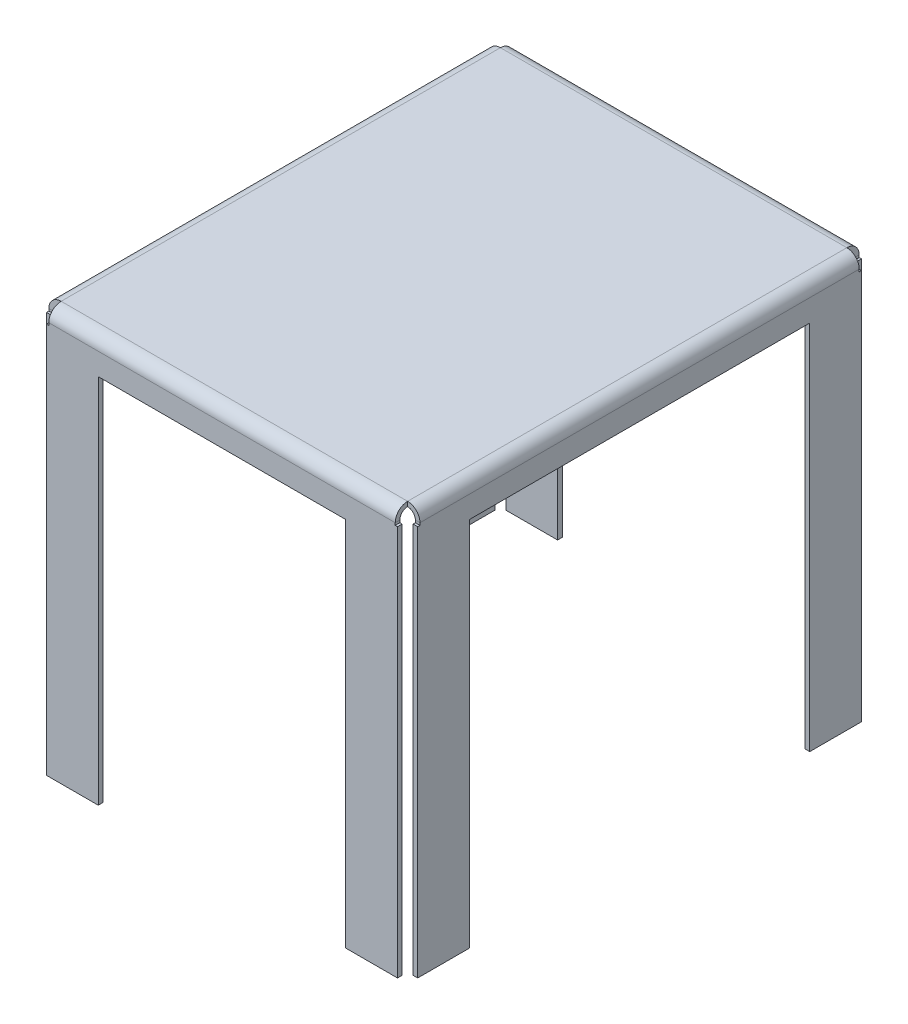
ISO-10303-21;
HEADER;
FILE_DESCRIPTION(('STEP AP214'),'2;1');
FILE_NAME('part.step','',(''),(''),'','','');
FILE_SCHEMA(('AUTOMOTIVE_DESIGN { 1 0 10303 214 1 1 1 1 }'));
ENDSEC;
DATA;
#1=APPLICATION_CONTEXT('core data for automotive mechanical design processes');
#2=APPLICATION_PROTOCOL_DEFINITION('international standard','automotive_design',2000,#1);
#3=PRODUCT_CONTEXT('',#1,'mechanical');
#4=PRODUCT('Part','Part','',(#3));
#5=PRODUCT_RELATED_PRODUCT_CATEGORY('part','',(#4));
#6=PRODUCT_DEFINITION_FORMATION('','',#4);
#7=PRODUCT_DEFINITION_CONTEXT('part definition',#1,'design');
#8=PRODUCT_DEFINITION('design','',#6,#7);
#9=PRODUCT_DEFINITION_SHAPE('','',#8);
#10=(LENGTH_UNIT() NAMED_UNIT(*) SI_UNIT(.MILLI.,.METRE.));
#11=(NAMED_UNIT(*) PLANE_ANGLE_UNIT() SI_UNIT($,.RADIAN.));
#12=(NAMED_UNIT(*) SI_UNIT($,.STERADIAN.) SOLID_ANGLE_UNIT());
#13=UNCERTAINTY_MEASURE_WITH_UNIT(LENGTH_MEASURE(1.E-05),#10,'distance_accuracy_value','');
#14=(GEOMETRIC_REPRESENTATION_CONTEXT(3) GLOBAL_UNCERTAINTY_ASSIGNED_CONTEXT((#13)) GLOBAL_UNIT_ASSIGNED_CONTEXT((#10,
#11,#12)) REPRESENTATION_CONTEXT('',''));
#15=CARTESIAN_POINT('',(0.,0.,0.));
#16=DIRECTION('',(0.,0.,1.));
#17=DIRECTION('',(1.,0.,0.));
#18=AXIS2_PLACEMENT_3D('',#15,#16,#17);
#19=CARTESIAN_POINT('',(297.18,-584.2,-336.466942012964));
#20=DIRECTION('',(1.,0.,0.));
#21=DIRECTION('',(0.,0.,-1.));
#22=AXIS2_PLACEMENT_3D('',#19,#20,#21);
#23=PLANE('',#22);
#24=DIRECTION('',(0.,0.,1.));
#25=VECTOR('',#24,1.);
#26=CARTESIAN_POINT('',(297.18,-609.6,-336.466942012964));
#27=LINE('',#26,#25);
#28=CARTESIAN_POINT('',(297.18,-609.6,-336.466942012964));
#29=VERTEX_POINT('',#28);
#30=CARTESIAN_POINT('',(297.18,-609.6,-296.585374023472));
#31=VERTEX_POINT('',#30);
#32=EDGE_CURVE('E109',#29,#31,#27,.T.);
#33=ORIENTED_EDGE('',*,*,#32,.F.);
#34=DIRECTION('',(0.,-1.,0.));
#35=VECTOR('',#34,1.);
#36=CARTESIAN_POINT('',(297.18,-584.2,-336.466942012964));
#37=LINE('',#36,#35);
#38=CARTESIAN_POINT('',(297.18,-584.2,-336.466942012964));
#39=VERTEX_POINT('',#38);
#40=EDGE_CURVE('E12',#39,#29,#37,.T.);
#41=ORIENTED_EDGE('',*,*,#40,.F.);
#42=DIRECTION('',(0.,0.,1.));
#43=VECTOR('',#42,1.);
#44=CARTESIAN_POINT('',(297.18,-584.2,-336.466942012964));
#45=LINE('',#44,#43);
#46=CARTESIAN_POINT('',(297.18,-584.2,-296.585374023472));
#47=VERTEX_POINT('',#46);
#48=EDGE_CURVE('E103',#39,#47,#45,.T.);
#49=ORIENTED_EDGE('',*,*,#48,.T.);
#50=DIRECTION('',(0.,-1.,0.));
#51=VECTOR('',#50,1.);
#52=CARTESIAN_POINT('',(297.18,-584.2,-296.585374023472));
#53=LINE('',#52,#51);
#54=EDGE_CURVE('E48',#47,#31,#53,.T.);
#55=ORIENTED_EDGE('',*,*,#54,.T.);
#56=EDGE_LOOP('',(#33,#41,#49,#55));
#57=FACE_BOUND('',#56,.T.);
#58=ADVANCED_FACE('F45',(#57),#23,.T.);
#59=CARTESIAN_POINT('',(260.101835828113,-584.2,-373.38));
#60=DIRECTION('',(0.70552716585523,0.,-0.708682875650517));
#61=DIRECTION('',(-0.708682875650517,0.,-0.70552716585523));
#62=AXIS2_PLACEMENT_3D('',#59,#60,#61);
#63=PLANE('',#62);
#64=DIRECTION('',(0.708682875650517,0.,0.70552716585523));
#65=VECTOR('',#64,1.);
#66=CARTESIAN_POINT('',(260.101835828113,-609.6,-373.38));
#67=LINE('',#66,#65);
#68=CARTESIAN_POINT('',(260.101835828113,-609.6,-373.38));
#69=VERTEX_POINT('',#68);
#70=EDGE_CURVE('E105',#69,#29,#67,.T.);
#71=ORIENTED_EDGE('',*,*,#70,.F.);
#72=DIRECTION('',(0.,-1.,0.));
#73=VECTOR('',#72,1.);
#74=CARTESIAN_POINT('',(260.101835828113,-584.2,-373.38));
#75=LINE('',#74,#73);
#76=CARTESIAN_POINT('',(260.101835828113,-584.2,-373.38));
#77=VERTEX_POINT('',#76);
#78=EDGE_CURVE('E54',#77,#69,#75,.T.);
#79=ORIENTED_EDGE('',*,*,#78,.F.);
#80=DIRECTION('',(0.708682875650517,0.,0.70552716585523));
#81=VECTOR('',#80,1.);
#82=CARTESIAN_POINT('',(260.101835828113,-584.2,-373.38));
#83=LINE('',#82,#81);
#84=EDGE_CURVE('E100',#77,#39,#83,.T.);
#85=ORIENTED_EDGE('',*,*,#84,.T.);
#86=ORIENTED_EDGE('',*,*,#40,.T.);
#87=EDGE_LOOP('',(#71,#79,#85,#86));
#88=FACE_BOUND('',#87,.T.);
#89=ADVANCED_FACE('F119',(#88),#63,.T.);
#90=CARTESIAN_POINT('',(220.041883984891,-584.2,-373.38));
#91=DIRECTION('',(0.,0.,-1.));
#92=DIRECTION('',(-1.,0.,0.));
#93=AXIS2_PLACEMENT_3D('',#90,#91,#92);
#94=PLANE('',#93);
#95=DIRECTION('',(1.,0.,0.));
#96=VECTOR('',#95,1.);
#97=CARTESIAN_POINT('',(220.041883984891,-609.6,-373.38));
#98=LINE('',#97,#96);
#99=CARTESIAN_POINT('',(220.041883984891,-609.6,-373.38));
#100=VERTEX_POINT('',#99);
#101=EDGE_CURVE('E95',#100,#69,#98,.T.);
#102=ORIENTED_EDGE('',*,*,#101,.F.);
#103=DIRECTION('',(0.,-1.,0.));
#104=VECTOR('',#103,1.);
#105=CARTESIAN_POINT('',(220.041883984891,-584.2,-373.38));
#106=LINE('',#105,#104);
#107=CARTESIAN_POINT('',(220.041883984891,-584.2,-373.38));
#108=VERTEX_POINT('',#107);
#109=EDGE_CURVE('E90',#108,#100,#106,.T.);
#110=ORIENTED_EDGE('',*,*,#109,.F.);
#111=DIRECTION('',(1.,0.,0.));
#112=VECTOR('',#111,1.);
#113=CARTESIAN_POINT('',(220.041883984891,-584.2,-373.38));
#114=LINE('',#113,#112);
#115=EDGE_CURVE('E93',#108,#77,#114,.T.);
#116=ORIENTED_EDGE('',*,*,#115,.T.);
#117=ORIENTED_EDGE('',*,*,#78,.T.);
#118=EDGE_LOOP('',(#102,#110,#116,#117));
#119=FACE_BOUND('',#118,.T.);
#120=ADVANCED_FACE('F92',(#119),#94,.T.);
#121=CARTESIAN_POINT('',(297.18,-584.2,-296.585374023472));
#122=DIRECTION('',(-0.70552716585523,0.,0.708682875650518));
#123=DIRECTION('',(0.708682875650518,0.,0.70552716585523));
#124=AXIS2_PLACEMENT_3D('',#121,#122,#123);
#125=PLANE('',#124);
#126=DIRECTION('',(-0.708682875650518,0.,-0.70552716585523));
#127=VECTOR('',#126,1.);
#128=CARTESIAN_POINT('',(297.18,-609.6,-296.585374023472));
#129=LINE('',#128,#127);
#130=EDGE_CURVE('E112',#31,#100,#129,.T.);
#131=ORIENTED_EDGE('',*,*,#130,.F.);
#132=ORIENTED_EDGE('',*,*,#54,.F.);
#133=DIRECTION('',(-0.708682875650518,0.,-0.70552716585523));
#134=VECTOR('',#133,1.);
#135=CARTESIAN_POINT('',(297.18,-584.2,-296.585374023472));
#136=LINE('',#135,#134);
#137=EDGE_CURVE('E99',#47,#108,#136,.T.);
#138=ORIENTED_EDGE('',*,*,#137,.T.);
#139=ORIENTED_EDGE('',*,*,#109,.T.);
#140=EDGE_LOOP('',(#131,#132,#138,#139));
#141=FACE_BOUND('',#140,.T.);
#142=ADVANCED_FACE('F102',(#141),#125,.T.);
#143=CARTESIAN_POINT('',(297.18,-584.2,-373.38));
#144=DIRECTION('',(0.,1.,0.));
#145=DIRECTION('',(0.,0.,1.));
#146=AXIS2_PLACEMENT_3D('',#143,#144,#145);
#147=PLANE('',#146);
#148=ORIENTED_EDGE('',*,*,#48,.F.);
#149=ORIENTED_EDGE('',*,*,#84,.F.);
#150=ORIENTED_EDGE('',*,*,#115,.F.);
#151=ORIENTED_EDGE('',*,*,#137,.F.);
#152=EDGE_LOOP('',(#148,#149,#150,#151));
#153=FACE_BOUND('',#152,.T.);
#154=ADVANCED_FACE('F98',(#153),#147,.T.);
#155=CARTESIAN_POINT('',(297.18,-609.6,-373.38));
#156=DIRECTION('',(0.,1.,0.));
#157=DIRECTION('',(0.,0.,1.));
#158=AXIS2_PLACEMENT_3D('',#155,#156,#157);
#159=PLANE('',#158);
#160=ORIENTED_EDGE('',*,*,#32,.T.);
#161=ORIENTED_EDGE('',*,*,#130,.T.);
#162=ORIENTED_EDGE('',*,*,#101,.T.);
#163=ORIENTED_EDGE('',*,*,#70,.T.);
#164=EDGE_LOOP('',(#160,#161,#162,#163));
#165=FACE_BOUND('',#164,.T.);
#166=ADVANCED_FACE('F118',(#165),#159,.F.);
#167=CLOSED_SHELL('',(#58,#89,#120,#142,#154,#166));
#168=MANIFOLD_SOLID_BREP('B2',#167);
#169=CARTESIAN_POINT('',(-284.48,36.068,360.68));
#170=DIRECTION('',(-1.,0.,0.));
#171=DIRECTION('',(0.,0.,1.));
#172=AXIS2_PLACEMENT_3D('',#169,#170,#171);
#173=PLANE('',#172);
#174=DIRECTION('',(0.,1.,0.));
#175=VECTOR('',#174,1.);
#176=CARTESIAN_POINT('',(-284.48,56.388,360.68));
#177=LINE('',#176,#175);
#178=CARTESIAN_POINT('',(-284.48,48.768,360.68));
#179=VERTEX_POINT('',#178);
#180=CARTESIAN_POINT('',(-284.48,56.388,360.68));
#181=VERTEX_POINT('',#180);
#182=EDGE_CURVE('E43',#179,#181,#177,.T.);
#183=ORIENTED_EDGE('',*,*,#182,.F.);
#184=CARTESIAN_POINT('',(-284.48,36.068,360.68));
#185=DIRECTION('',(-1.,0.,0.));
#186=DIRECTION('',(0.,0.,1.));
#187=AXIS2_PLACEMENT_3D('',#184,#185,#186);
#188=CIRCLE('',#187,12.7);
#189=CARTESIAN_POINT('',(-284.48,36.068,373.38));
#190=VERTEX_POINT('',#189);
#191=EDGE_CURVE('E351',#179,#190,#188,.F.);
#192=ORIENTED_EDGE('',*,*,#191,.T.);
#193=DIRECTION('',(0.,0.,1.));
#194=VECTOR('',#193,1.);
#195=CARTESIAN_POINT('',(-284.48,36.068,381.));
#196=LINE('',#195,#194);
#197=CARTESIAN_POINT('',(-284.48,36.068,381.));
#198=VERTEX_POINT('',#197);
#199=EDGE_CURVE('E179',#190,#198,#196,.T.);
#200=ORIENTED_EDGE('',*,*,#199,.T.);
#201=CARTESIAN_POINT('',(-284.48,36.068,360.68));
#202=DIRECTION('',(1.,0.,0.));
#203=DIRECTION('',(0.,0.,-1.));
#204=AXIS2_PLACEMENT_3D('',#201,#202,#203);
#205=CIRCLE('',#204,20.32);
#206=EDGE_CURVE('E354',#181,#198,#205,.T.);
#207=ORIENTED_EDGE('',*,*,#206,.F.);
#208=EDGE_LOOP('',(#183,#192,#200,#207));
#209=FACE_BOUND('',#208,.T.);
#210=ADVANCED_FACE('F169',(#209),#173,.T.);
#211=CARTESIAN_POINT('',(-284.48,56.388,381.));
#212=DIRECTION('',(1.,0.,0.));
#213=DIRECTION('',(0.,-1.,0.));
#214=AXIS2_PLACEMENT_3D('',#211,#212,#213);
#215=PLANE('',#214);
#216=ORIENTED_EDGE('',*,*,#199,.F.);
#217=DIRECTION('',(0.,1.,0.));
#218=VECTOR('',#217,1.);
#219=CARTESIAN_POINT('',(-284.48,56.388,373.38));
#220=LINE('',#219,#218);
#221=CARTESIAN_POINT('',(-284.48,32.265969,373.38));
#222=VERTEX_POINT('',#221);
#223=EDGE_CURVE('E646',#190,#222,#220,.F.);
#224=ORIENTED_EDGE('',*,*,#223,.T.);
#225=DIRECTION('',(0.,0.,1.));
#226=VECTOR('',#225,1.);
#227=CARTESIAN_POINT('',(-284.48,32.265969,381.));
#228=LINE('',#227,#226);
#229=CARTESIAN_POINT('',(-284.48,32.265969,381.));
#230=VERTEX_POINT('',#229);
#231=EDGE_CURVE('E552',#222,#230,#228,.T.);
#232=ORIENTED_EDGE('',*,*,#231,.T.);
#233=DIRECTION('',(0.,-1.,0.));
#234=VECTOR('',#233,1.);
#235=CARTESIAN_POINT('',(-284.48,56.388,381.));
#236=LINE('',#235,#234);
#237=EDGE_CURVE('E575',#198,#230,#236,.T.);
#238=ORIENTED_EDGE('',*,*,#237,.F.);
#239=EDGE_LOOP('',(#216,#224,#232,#238));
#240=FACE_BOUND('',#239,.T.);
#241=ADVANCED_FACE('F576',(#240),#215,.F.);
#242=CARTESIAN_POINT('',(-304.8,32.265969,381.));
#243=DIRECTION('',(0.,1.,0.));
#244=DIRECTION('',(1.,0.,0.));
#245=AXIS2_PLACEMENT_3D('',#242,#243,#244);
#246=PLANE('',#245);
#247=ORIENTED_EDGE('',*,*,#231,.F.);
#248=DIRECTION('',(-1.,0.,0.));
#249=VECTOR('',#248,1.);
#250=CARTESIAN_POINT('',(-304.8,32.265969,373.38));
#251=LINE('',#250,#249);
#252=CARTESIAN_POINT('',(-288.199743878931,32.265969,373.38));
#253=VERTEX_POINT('',#252);
#254=EDGE_CURVE('E678',#253,#222,#251,.F.);
#255=ORIENTED_EDGE('',*,*,#254,.F.);
#256=DIRECTION('',(0.,0.,1.));
#257=VECTOR('',#256,1.);
#258=CARTESIAN_POINT('',(-288.199743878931,32.265969,381.));
#259=LINE('',#258,#257);
#260=CARTESIAN_POINT('',(-288.199743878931,32.265969,381.));
#261=VERTEX_POINT('',#260);
#262=EDGE_CURVE('E549',#253,#261,#259,.T.);
#263=ORIENTED_EDGE('',*,*,#262,.T.);
#264=DIRECTION('',(1.,0.,0.));
#265=VECTOR('',#264,1.);
#266=CARTESIAN_POINT('',(-304.8,32.265969,381.));
#267=LINE('',#266,#265);
#268=EDGE_CURVE('E582',#261,#230,#267,.T.);
#269=ORIENTED_EDGE('',*,*,#268,.T.);
#270=EDGE_LOOP('',(#247,#255,#263,#269));
#271=FACE_BOUND('',#270,.T.);
#272=ADVANCED_FACE('F780',(#271),#246,.T.);
#273=CARTESIAN_POINT('',(-288.199743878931,56.388,381.));
#274=DIRECTION('',(1.,0.,0.));
#275=DIRECTION('',(0.,-1.,0.));
#276=AXIS2_PLACEMENT_3D('',#273,#274,#275);
#277=PLANE('',#276);
#278=ORIENTED_EDGE('',*,*,#262,.F.);
#279=DIRECTION('',(0.,1.,0.));
#280=VECTOR('',#279,1.);
#281=CARTESIAN_POINT('',(-288.199743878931,56.388,373.38));
#282=LINE('',#281,#280);
#283=CARTESIAN_POINT('',(-288.199743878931,-609.6,373.38));
#284=VERTEX_POINT('',#283);
#285=EDGE_CURVE('E651',#253,#284,#282,.F.);
#286=ORIENTED_EDGE('',*,*,#285,.T.);
#287=DIRECTION('',(0.,0.,1.));
#288=VECTOR('',#287,1.);
#289=CARTESIAN_POINT('',(-288.199743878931,-609.6,381.));
#290=LINE('',#289,#288);
#291=CARTESIAN_POINT('',(-288.199743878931,-609.6,381.));
#292=VERTEX_POINT('',#291);
#293=EDGE_CURVE('E546',#284,#292,#290,.T.);
#294=ORIENTED_EDGE('',*,*,#293,.T.);
#295=DIRECTION('',(0.,-1.,0.));
#296=VECTOR('',#295,1.);
#297=CARTESIAN_POINT('',(-288.199743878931,56.388,381.));
#298=LINE('',#297,#296);
#299=EDGE_CURVE('E1043',#261,#292,#298,.T.);
#300=ORIENTED_EDGE('',*,*,#299,.F.);
#301=EDGE_LOOP('',(#278,#286,#294,#300));
#302=FACE_BOUND('',#301,.T.);
#303=ADVANCED_FACE('F1096',(#302),#277,.F.);
#304=CARTESIAN_POINT('',(-304.8,-609.6,381.));
#305=DIRECTION('',(0.,-1.,0.));
#306=DIRECTION('',(-1.,0.,0.));
#307=AXIS2_PLACEMENT_3D('',#304,#305,#306);
#308=PLANE('',#307);
#309=ORIENTED_EDGE('',*,*,#293,.F.);
#310=DIRECTION('',(-1.,0.,0.));
#311=VECTOR('',#310,1.);
#312=CARTESIAN_POINT('',(-304.8,-609.6,373.38));
#313=LINE('',#312,#311);
#314=CARTESIAN_POINT('',(-203.2,-609.6,373.38));
#315=VERTEX_POINT('',#314);
#316=EDGE_CURVE('E728',#315,#284,#313,.T.);
#317=ORIENTED_EDGE('',*,*,#316,.F.);
#318=DIRECTION('',(0.,0.,1.));
#319=VECTOR('',#318,1.);
#320=CARTESIAN_POINT('',(-203.2,-609.6,381.));
#321=LINE('',#320,#319);
#322=CARTESIAN_POINT('',(-203.2,-609.6,381.));
#323=VERTEX_POINT('',#322);
#324=EDGE_CURVE('E541',#315,#323,#321,.T.);
#325=ORIENTED_EDGE('',*,*,#324,.T.);
#326=DIRECTION('',(-1.,0.,0.));
#327=VECTOR('',#326,1.);
#328=CARTESIAN_POINT('',(-304.8,-609.6,381.));
#329=LINE('',#328,#327);
#330=EDGE_CURVE('E1001',#323,#292,#329,.T.);
#331=ORIENTED_EDGE('',*,*,#330,.T.);
#332=EDGE_LOOP('',(#309,#317,#325,#331));
#333=FACE_BOUND('',#332,.T.);
#334=ADVANCED_FACE('F1099',(#333),#308,.T.);
#335=CARTESIAN_POINT('',(-203.2,-609.6,381.));
#336=DIRECTION('',(-1.,0.,0.));
#337=DIRECTION('',(0.,1.,0.));
#338=AXIS2_PLACEMENT_3D('',#335,#336,#337);
#339=PLANE('',#338);
#340=ORIENTED_EDGE('',*,*,#324,.F.);
#341=DIRECTION('',(0.,1.,0.));
#342=VECTOR('',#341,1.);
#343=CARTESIAN_POINT('',(-203.2,56.388,373.38));
#344=LINE('',#343,#342);
#345=CARTESIAN_POINT('',(-203.2,0.,373.38));
#346=VERTEX_POINT('',#345);
#347=EDGE_CURVE('E766',#315,#346,#344,.T.);
#348=ORIENTED_EDGE('',*,*,#347,.T.);
#349=DIRECTION('',(0.,0.,1.));
#350=VECTOR('',#349,1.);
#351=CARTESIAN_POINT('',(-203.2,0.,381.));
#352=LINE('',#351,#350);
#353=CARTESIAN_POINT('',(-203.2,0.,381.));
#354=VERTEX_POINT('',#353);
#355=EDGE_CURVE('E538',#346,#354,#352,.T.);
#356=ORIENTED_EDGE('',*,*,#355,.T.);
#357=DIRECTION('',(0.,1.,0.));
#358=VECTOR('',#357,1.);
#359=CARTESIAN_POINT('',(-203.2,-609.6,381.));
#360=LINE('',#359,#358);
#361=EDGE_CURVE('E1004',#323,#354,#360,.T.);
#362=ORIENTED_EDGE('',*,*,#361,.F.);
#363=EDGE_LOOP('',(#340,#348,#356,#362));
#364=FACE_BOUND('',#363,.T.);
#365=ADVANCED_FACE('F1103',(#364),#339,.F.);
#366=CARTESIAN_POINT('',(-304.8,0.,381.));
#367=DIRECTION('',(0.,1.,0.));
#368=DIRECTION('',(1.,0.,0.));
#369=AXIS2_PLACEMENT_3D('',#366,#367,#368);
#370=PLANE('',#369);
#371=ORIENTED_EDGE('',*,*,#355,.F.);
#372=DIRECTION('',(-1.,0.,0.));
#373=VECTOR('',#372,1.);
#374=CARTESIAN_POINT('',(-304.8,0.,373.38));
#375=LINE('',#374,#373);
#376=CARTESIAN_POINT('',(203.2,0.,373.38));
#377=VERTEX_POINT('',#376);
#378=EDGE_CURVE('E763',#346,#377,#375,.F.);
#379=ORIENTED_EDGE('',*,*,#378,.T.);
#380=DIRECTION('',(0.,0.,1.));
#381=VECTOR('',#380,1.);
#382=CARTESIAN_POINT('',(203.2,0.,381.));
#383=LINE('',#382,#381);
#384=CARTESIAN_POINT('',(203.2,0.,381.));
#385=VERTEX_POINT('',#384);
#386=EDGE_CURVE('E535',#377,#385,#383,.T.);
#387=ORIENTED_EDGE('',*,*,#386,.T.);
#388=DIRECTION('',(1.,0.,0.));
#389=VECTOR('',#388,1.);
#390=CARTESIAN_POINT('',(-304.8,0.,381.));
#391=LINE('',#390,#389);
#392=EDGE_CURVE('E1007',#354,#385,#391,.T.);
#393=ORIENTED_EDGE('',*,*,#392,.F.);
#394=EDGE_LOOP('',(#371,#379,#387,#393));
#395=FACE_BOUND('',#394,.T.);
#396=ADVANCED_FACE('F1107',(#395),#370,.F.);
#397=CARTESIAN_POINT('',(203.2,-609.6,381.));
#398=DIRECTION('',(-1.,0.,0.));
#399=DIRECTION('',(0.,1.,0.));
#400=AXIS2_PLACEMENT_3D('',#397,#398,#399);
#401=PLANE('',#400);
#402=ORIENTED_EDGE('',*,*,#386,.F.);
#403=DIRECTION('',(0.,1.,0.));
#404=VECTOR('',#403,1.);
#405=CARTESIAN_POINT('',(203.2,56.388,373.38));
#406=LINE('',#405,#404);
#407=CARTESIAN_POINT('',(203.2,-609.6,373.38));
#408=VERTEX_POINT('',#407);
#409=EDGE_CURVE('E760',#408,#377,#406,.T.);
#410=ORIENTED_EDGE('',*,*,#409,.F.);
#411=DIRECTION('',(0.,0.,1.));
#412=VECTOR('',#411,1.);
#413=CARTESIAN_POINT('',(203.2,-609.6,381.));
#414=LINE('',#413,#412);
#415=CARTESIAN_POINT('',(203.2,-609.6,381.));
#416=VERTEX_POINT('',#415);
#417=EDGE_CURVE('E532',#408,#416,#414,.T.);
#418=ORIENTED_EDGE('',*,*,#417,.T.);
#419=DIRECTION('',(0.,1.,0.));
#420=VECTOR('',#419,1.);
#421=CARTESIAN_POINT('',(203.2,-609.6,381.));
#422=LINE('',#421,#420);
#423=EDGE_CURVE('E1012',#416,#385,#422,.T.);
#424=ORIENTED_EDGE('',*,*,#423,.T.);
#425=EDGE_LOOP('',(#402,#410,#418,#424));
#426=FACE_BOUND('',#425,.T.);
#427=ADVANCED_FACE('F1111',(#426),#401,.T.);
#428=CARTESIAN_POINT('',(304.8,-609.6,381.));
#429=DIRECTION('',(0.,1.,0.));
#430=DIRECTION('',(1.,0.,0.));
#431=AXIS2_PLACEMENT_3D('',#428,#429,#430);
#432=PLANE('',#431);
#433=ORIENTED_EDGE('',*,*,#417,.F.);
#434=DIRECTION('',(-1.,0.,0.));
#435=VECTOR('',#434,1.);
#436=CARTESIAN_POINT('',(-304.8,-609.6,373.38));
#437=LINE('',#436,#435);
#438=CARTESIAN_POINT('',(288.199743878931,-609.6,373.38));
#439=VERTEX_POINT('',#438);
#440=EDGE_CURVE('E668',#408,#439,#437,.F.);
#441=ORIENTED_EDGE('',*,*,#440,.T.);
#442=DIRECTION('',(0.,0.,1.));
#443=VECTOR('',#442,1.);
#444=CARTESIAN_POINT('',(288.199743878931,-609.6,381.));
#445=LINE('',#444,#443);
#446=CARTESIAN_POINT('',(288.199743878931,-609.6,381.));
#447=VERTEX_POINT('',#446);
#448=EDGE_CURVE('E529',#439,#447,#445,.T.);
#449=ORIENTED_EDGE('',*,*,#448,.T.);
#450=DIRECTION('',(1.,0.,0.));
#451=VECTOR('',#450,1.);
#452=CARTESIAN_POINT('',(304.8,-609.6,381.));
#453=LINE('',#452,#451);
#454=EDGE_CURVE('E1017',#416,#447,#453,.T.);
#455=ORIENTED_EDGE('',*,*,#454,.F.);
#456=EDGE_LOOP('',(#433,#441,#449,#455));
#457=FACE_BOUND('',#456,.T.);
#458=ADVANCED_FACE('F1115',(#457),#432,.F.);
#459=CARTESIAN_POINT('',(288.199743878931,56.388,381.));
#460=DIRECTION('',(-1.,0.,0.));
#461=DIRECTION('',(0.,1.,0.));
#462=AXIS2_PLACEMENT_3D('',#459,#460,#461);
#463=PLANE('',#462);
#464=ORIENTED_EDGE('',*,*,#448,.F.);
#465=DIRECTION('',(0.,1.,0.));
#466=VECTOR('',#465,1.);
#467=CARTESIAN_POINT('',(288.199743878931,56.388,373.38));
#468=LINE('',#467,#466);
#469=CARTESIAN_POINT('',(288.199743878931,32.265969,373.38));
#470=VERTEX_POINT('',#469);
#471=EDGE_CURVE('E709',#439,#470,#468,.T.);
#472=ORIENTED_EDGE('',*,*,#471,.T.);
#473=DIRECTION('',(0.,0.,1.));
#474=VECTOR('',#473,1.);
#475=CARTESIAN_POINT('',(288.199743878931,32.265969,381.));
#476=LINE('',#475,#474);
#477=CARTESIAN_POINT('',(288.199743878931,32.265969,381.));
#478=VERTEX_POINT('',#477);
#479=EDGE_CURVE('E526',#470,#478,#476,.T.);
#480=ORIENTED_EDGE('',*,*,#479,.T.);
#481=DIRECTION('',(0.,1.,0.));
#482=VECTOR('',#481,1.);
#483=CARTESIAN_POINT('',(288.199743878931,56.388,381.));
#484=LINE('',#483,#482);
#485=EDGE_CURVE('E816',#447,#478,#484,.T.);
#486=ORIENTED_EDGE('',*,*,#485,.F.);
#487=EDGE_LOOP('',(#464,#472,#480,#486));
#488=FACE_BOUND('',#487,.T.);
#489=ADVANCED_FACE('F1119',(#488),#463,.F.);
#490=CARTESIAN_POINT('',(-304.8,32.265969,381.));
#491=DIRECTION('',(0.,1.,0.));
#492=DIRECTION('',(1.,0.,0.));
#493=AXIS2_PLACEMENT_3D('',#490,#491,#492);
#494=PLANE('',#493);
#495=ORIENTED_EDGE('',*,*,#479,.F.);
#496=DIRECTION('',(-1.,0.,0.));
#497=VECTOR('',#496,1.);
#498=CARTESIAN_POINT('',(-304.8,32.265969,373.38));
#499=LINE('',#498,#497);
#500=CARTESIAN_POINT('',(284.48,32.265969,373.38));
#501=VERTEX_POINT('',#500);
#502=EDGE_CURVE('E747',#501,#470,#499,.F.);
#503=ORIENTED_EDGE('',*,*,#502,.F.);
#504=DIRECTION('',(0.,0.,1.));
#505=VECTOR('',#504,1.);
#506=CARTESIAN_POINT('',(284.48,32.265969,381.));
#507=LINE('',#506,#505);
#508=CARTESIAN_POINT('',(284.48,32.265969,381.));
#509=VERTEX_POINT('',#508);
#510=EDGE_CURVE('E523',#501,#509,#507,.T.);
#511=ORIENTED_EDGE('',*,*,#510,.T.);
#512=DIRECTION('',(1.,0.,0.));
#513=VECTOR('',#512,1.);
#514=CARTESIAN_POINT('',(-304.8,32.265969,381.));
#515=LINE('',#514,#513);
#516=EDGE_CURVE('E804',#509,#478,#515,.T.);
#517=ORIENTED_EDGE('',*,*,#516,.T.);
#518=EDGE_LOOP('',(#495,#503,#511,#517));
#519=FACE_BOUND('',#518,.T.);
#520=ADVANCED_FACE('F808',(#519),#494,.T.);
#521=CARTESIAN_POINT('',(284.48,56.388,381.));
#522=DIRECTION('',(-1.,0.,0.));
#523=DIRECTION('',(0.,1.,0.));
#524=AXIS2_PLACEMENT_3D('',#521,#522,#523);
#525=PLANE('',#524);
#526=ORIENTED_EDGE('',*,*,#510,.F.);
#527=DIRECTION('',(0.,1.,0.));
#528=VECTOR('',#527,1.);
#529=CARTESIAN_POINT('',(284.48,56.388,373.38));
#530=LINE('',#529,#528);
#531=CARTESIAN_POINT('',(284.48,36.068,373.38));
#532=VERTEX_POINT('',#531);
#533=EDGE_CURVE('E387',#501,#532,#530,.T.);
#534=ORIENTED_EDGE('',*,*,#533,.T.);
#535=DIRECTION('',(0.,0.,1.));
#536=VECTOR('',#535,1.);
#537=CARTESIAN_POINT('',(284.48,36.068,381.));
#538=LINE('',#537,#536);
#539=CARTESIAN_POINT('',(284.48,36.068,381.));
#540=VERTEX_POINT('',#539);
#541=EDGE_CURVE('E520',#532,#540,#538,.T.);
#542=ORIENTED_EDGE('',*,*,#541,.T.);
#543=DIRECTION('',(0.,1.,0.));
#544=VECTOR('',#543,1.);
#545=CARTESIAN_POINT('',(284.48,56.388,381.));
#546=LINE('',#545,#544);
#547=EDGE_CURVE('E588',#509,#540,#546,.T.);
#548=ORIENTED_EDGE('',*,*,#547,.F.);
#549=EDGE_LOOP('',(#526,#534,#542,#548));
#550=FACE_BOUND('',#549,.T.);
#551=ADVANCED_FACE('F820',(#550),#525,.F.);
#552=CARTESIAN_POINT('',(284.48,36.068,360.68));
#553=DIRECTION('',(1.,0.,0.));
#554=DIRECTION('',(0.,0.,-1.));
#555=AXIS2_PLACEMENT_3D('',#552,#553,#554);
#556=PLANE('',#555);
#557=ORIENTED_EDGE('',*,*,#541,.F.);
#558=CARTESIAN_POINT('',(284.48,36.068,360.68));
#559=DIRECTION('',(-1.,0.,0.));
#560=DIRECTION('',(0.,0.,1.));
#561=AXIS2_PLACEMENT_3D('',#558,#559,#560);
#562=CIRCLE('',#561,12.7);
#563=CARTESIAN_POINT('',(284.48,48.768,360.68));
#564=VERTEX_POINT('',#563);
#565=EDGE_CURVE('E394',#532,#564,#562,.T.);
#566=ORIENTED_EDGE('',*,*,#565,.T.);
#567=DIRECTION('',(0.,1.,0.));
#568=VECTOR('',#567,1.);
#569=CARTESIAN_POINT('',(284.48,56.388,360.68));
#570=LINE('',#569,#568);
#571=CARTESIAN_POINT('',(284.48,56.388,360.68));
#572=VERTEX_POINT('',#571);
#573=EDGE_CURVE('E517',#564,#572,#570,.T.);
#574=ORIENTED_EDGE('',*,*,#573,.T.);
#575=CARTESIAN_POINT('',(284.48,36.068,360.68));
#576=DIRECTION('',(-1.,0.,0.));
#577=DIRECTION('',(0.,0.,1.));
#578=AXIS2_PLACEMENT_3D('',#575,#576,#577);
#579=CIRCLE('',#578,20.32);
#580=EDGE_CURVE('E572',#540,#572,#579,.T.);
#581=ORIENTED_EDGE('',*,*,#580,.F.);
#582=EDGE_LOOP('',(#557,#566,#574,#581));
#583=FACE_BOUND('',#582,.T.);
#584=ADVANCED_FACE('F824',(#583),#556,.T.);
#585=CARTESIAN_POINT('',(284.48,36.068,360.68));
#586=DIRECTION('',(0.,0.,1.));
#587=DIRECTION('',(1.,0.,0.));
#588=AXIS2_PLACEMENT_3D('',#585,#586,#587);
#589=PLANE('',#588);
#590=ORIENTED_EDGE('',*,*,#573,.F.);
#591=CARTESIAN_POINT('',(284.48,36.068,360.68));
#592=DIRECTION('',(0.,0.,1.));
#593=DIRECTION('',(1.,0.,0.));
#594=AXIS2_PLACEMENT_3D('',#591,#592,#593);
#595=CIRCLE('',#594,12.7);
#596=CARTESIAN_POINT('',(297.18,36.068,360.68));
#597=VERTEX_POINT('',#596);
#598=EDGE_CURVE('E681',#564,#597,#595,.F.);
#599=ORIENTED_EDGE('',*,*,#598,.T.);
#600=DIRECTION('',(1.,0.,0.));
#601=VECTOR('',#600,1.);
#602=CARTESIAN_POINT('',(304.8,36.068,360.68));
#603=LINE('',#602,#601);
#604=CARTESIAN_POINT('',(304.8,36.068,360.68));
#605=VERTEX_POINT('',#604);
#606=EDGE_CURVE('E515',#597,#605,#603,.T.);
#607=ORIENTED_EDGE('',*,*,#606,.T.);
#608=CARTESIAN_POINT('',(284.48,36.068,360.68));
#609=DIRECTION('',(0.,0.,-1.));
#610=DIRECTION('',(-1.,0.,0.));
#611=AXIS2_PLACEMENT_3D('',#608,#609,#610);
#612=CIRCLE('',#611,20.32);
#613=EDGE_CURVE('E615',#572,#605,#612,.T.);
#614=ORIENTED_EDGE('',*,*,#613,.F.);
#615=EDGE_LOOP('',(#590,#599,#607,#614));
#616=FACE_BOUND('',#615,.T.);
#617=ADVANCED_FACE('F828',(#616),#589,.T.);
#618=CARTESIAN_POINT('',(304.8,56.388,360.68));
#619=DIRECTION('',(0.,0.,-1.));
#620=DIRECTION('',(0.,-1.,0.));
#621=AXIS2_PLACEMENT_3D('',#618,#619,#620);
#622=PLANE('',#621);
#623=ORIENTED_EDGE('',*,*,#606,.F.);
#624=DIRECTION('',(0.,1.,0.));
#625=VECTOR('',#624,1.);
#626=CARTESIAN_POINT('',(297.18,56.388,360.68));
#627=LINE('',#626,#625);
#628=CARTESIAN_POINT('',(297.18,32.265969,360.68));
#629=VERTEX_POINT('',#628);
#630=EDGE_CURVE('E744',#597,#629,#627,.F.);
#631=ORIENTED_EDGE('',*,*,#630,.T.);
#632=DIRECTION('',(1.,0.,0.));
#633=VECTOR('',#632,1.);
#634=CARTESIAN_POINT('',(304.8,32.265969,360.68));
#635=LINE('',#634,#633);
#636=CARTESIAN_POINT('',(304.8,32.265969,360.68));
#637=VERTEX_POINT('',#636);
#638=EDGE_CURVE('E512',#629,#637,#635,.T.);
#639=ORIENTED_EDGE('',*,*,#638,.T.);
#640=DIRECTION('',(0.,-1.,0.));
#641=VECTOR('',#640,1.);
#642=CARTESIAN_POINT('',(304.8,56.388,360.68));
#643=LINE('',#642,#641);
#644=EDGE_CURVE('E801',#605,#637,#643,.T.);
#645=ORIENTED_EDGE('',*,*,#644,.F.);
#646=EDGE_LOOP('',(#623,#631,#639,#645));
#647=FACE_BOUND('',#646,.T.);
#648=ADVANCED_FACE('F1132',(#647),#622,.F.);
#649=CARTESIAN_POINT('',(304.8,32.265969,-381.));
#650=DIRECTION('',(0.,1.,0.));
#651=DIRECTION('',(0.,0.,-1.));
#652=AXIS2_PLACEMENT_3D('',#649,#650,#651);
#653=PLANE('',#652);
#654=ORIENTED_EDGE('',*,*,#638,.F.);
#655=DIRECTION('',(0.,0.,1.));
#656=VECTOR('',#655,1.);
#657=CARTESIAN_POINT('',(297.18,32.265969,-381.));
#658=LINE('',#657,#656);
#659=CARTESIAN_POINT('',(297.18,32.265969,364.399743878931));
#660=VERTEX_POINT('',#659);
#661=EDGE_CURVE('E642',#660,#629,#658,.F.);
#662=ORIENTED_EDGE('',*,*,#661,.F.);
#663=DIRECTION('',(1.,0.,0.));
#664=VECTOR('',#663,1.);
#665=CARTESIAN_POINT('',(304.8,32.265969,364.399743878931));
#666=LINE('',#665,#664);
#667=CARTESIAN_POINT('',(304.8,32.265969,364.399743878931));
#668=VERTEX_POINT('',#667);
#669=EDGE_CURVE('E509',#660,#668,#666,.T.);
#670=ORIENTED_EDGE('',*,*,#669,.T.);
#671=DIRECTION('',(0.,0.,-1.));
#672=VECTOR('',#671,1.);
#673=CARTESIAN_POINT('',(304.8,32.265969,-381.));
#674=LINE('',#673,#672);
#675=EDGE_CURVE('E798',#668,#637,#674,.T.);
#676=ORIENTED_EDGE('',*,*,#675,.T.);
#677=EDGE_LOOP('',(#654,#662,#670,#676));
#678=FACE_BOUND('',#677,.T.);
#679=ADVANCED_FACE('F1135',(#678),#653,.T.);
#680=CARTESIAN_POINT('',(304.8,56.388,364.399743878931));
#681=DIRECTION('',(0.,0.,-1.));
#682=DIRECTION('',(0.,-1.,0.));
#683=AXIS2_PLACEMENT_3D('',#680,#681,#682);
#684=PLANE('',#683);
#685=ORIENTED_EDGE('',*,*,#669,.F.);
#686=DIRECTION('',(0.,1.,0.));
#687=VECTOR('',#686,1.);
#688=CARTESIAN_POINT('',(297.18,56.388,364.399743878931));
#689=LINE('',#688,#687);
#690=CARTESIAN_POINT('',(297.18,-609.6,364.399743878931));
#691=VERTEX_POINT('',#690);
#692=EDGE_CURVE('E650',#660,#691,#689,.F.);
#693=ORIENTED_EDGE('',*,*,#692,.T.);
#694=DIRECTION('',(1.,0.,0.));
#695=VECTOR('',#694,1.);
#696=CARTESIAN_POINT('',(304.8,-609.6,364.399743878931));
#697=LINE('',#696,#695);
#698=CARTESIAN_POINT('',(304.8,-609.6,364.399743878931));
#699=VERTEX_POINT('',#698);
#700=EDGE_CURVE('E506',#691,#699,#697,.T.);
#701=ORIENTED_EDGE('',*,*,#700,.T.);
#702=DIRECTION('',(0.,-1.,0.));
#703=VECTOR('',#702,1.);
#704=CARTESIAN_POINT('',(304.8,56.388,364.399743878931));
#705=LINE('',#704,#703);
#706=EDGE_CURVE('E1048',#668,#699,#705,.T.);
#707=ORIENTED_EDGE('',*,*,#706,.F.);
#708=EDGE_LOOP('',(#685,#693,#701,#707));
#709=FACE_BOUND('',#708,.T.);
#710=ADVANCED_FACE('F1139',(#709),#684,.F.);
#711=CARTESIAN_POINT('',(304.8,-609.6,381.));
#712=DIRECTION('',(0.,1.,0.));
#713=DIRECTION('',(0.,0.,-1.));
#714=AXIS2_PLACEMENT_3D('',#711,#712,#713);
#715=PLANE('',#714);
#716=ORIENTED_EDGE('',*,*,#700,.F.);
#717=DIRECTION('',(0.,0.,1.));
#718=VECTOR('',#717,1.);
#719=CARTESIAN_POINT('',(297.18,-609.6,-381.));
#720=LINE('',#719,#718);
#721=CARTESIAN_POINT('',(297.18,-609.6,279.4));
#722=VERTEX_POINT('',#721);
#723=EDGE_CURVE('E693',#691,#722,#720,.F.);
#724=ORIENTED_EDGE('',*,*,#723,.T.);
#725=DIRECTION('',(1.,0.,0.));
#726=VECTOR('',#725,1.);
#727=CARTESIAN_POINT('',(304.8,-609.6,279.4));
#728=LINE('',#727,#726);
#729=CARTESIAN_POINT('',(304.8,-609.6,279.4));
#730=VERTEX_POINT('',#729);
#731=EDGE_CURVE('E503',#722,#730,#728,.T.);
#732=ORIENTED_EDGE('',*,*,#731,.T.);
#733=DIRECTION('',(0.,0.,-1.));
#734=VECTOR('',#733,1.);
#735=CARTESIAN_POINT('',(304.8,-609.6,381.));
#736=LINE('',#735,#734);
#737=EDGE_CURVE('E986',#699,#730,#736,.T.);
#738=ORIENTED_EDGE('',*,*,#737,.F.);
#739=EDGE_LOOP('',(#716,#724,#732,#738));
#740=FACE_BOUND('',#739,.T.);
#741=ADVANCED_FACE('F1143',(#740),#715,.F.);
#742=CARTESIAN_POINT('',(304.8,-609.6,279.4));
#743=DIRECTION('',(0.,0.,1.));
#744=DIRECTION('',(0.,1.,0.));
#745=AXIS2_PLACEMENT_3D('',#742,#743,#744);
#746=PLANE('',#745);
#747=ORIENTED_EDGE('',*,*,#731,.F.);
#748=DIRECTION('',(0.,1.,0.));
#749=VECTOR('',#748,1.);
#750=CARTESIAN_POINT('',(297.18,56.388,279.4));
#751=LINE('',#750,#749);
#752=CARTESIAN_POINT('',(297.18,0.,279.4));
#753=VERTEX_POINT('',#752);
#754=EDGE_CURVE('E735',#722,#753,#751,.T.);
#755=ORIENTED_EDGE('',*,*,#754,.T.);
#756=DIRECTION('',(1.,0.,0.));
#757=VECTOR('',#756,1.);
#758=CARTESIAN_POINT('',(304.8,0.,279.4));
#759=LINE('',#758,#757);
#760=CARTESIAN_POINT('',(304.8,0.,279.4));
#761=VERTEX_POINT('',#760);
#762=EDGE_CURVE('E500',#753,#761,#759,.T.);
#763=ORIENTED_EDGE('',*,*,#762,.T.);
#764=DIRECTION('',(0.,1.,0.));
#765=VECTOR('',#764,1.);
#766=CARTESIAN_POINT('',(304.8,-609.6,279.4));
#767=LINE('',#766,#765);
#768=EDGE_CURVE('E989',#730,#761,#767,.T.);
#769=ORIENTED_EDGE('',*,*,#768,.F.);
#770=EDGE_LOOP('',(#747,#755,#763,#769));
#771=FACE_BOUND('',#770,.T.);
#772=ADVANCED_FACE('F1147',(#771),#746,.F.);
#773=CARTESIAN_POINT('',(304.8,0.,-381.));
#774=DIRECTION('',(0.,1.,0.));
#775=DIRECTION('',(0.,0.,-1.));
#776=AXIS2_PLACEMENT_3D('',#773,#774,#775);
#777=PLANE('',#776);
#778=ORIENTED_EDGE('',*,*,#762,.F.);
#779=DIRECTION('',(0.,0.,1.));
#780=VECTOR('',#779,1.);
#781=CARTESIAN_POINT('',(297.18,0.,-381.));
#782=LINE('',#781,#780);
#783=CARTESIAN_POINT('',(297.18,0.,-279.4));
#784=VERTEX_POINT('',#783);
#785=EDGE_CURVE('E732',#753,#784,#782,.F.);
#786=ORIENTED_EDGE('',*,*,#785,.T.);
#787=DIRECTION('',(1.,0.,0.));
#788=VECTOR('',#787,1.);
#789=CARTESIAN_POINT('',(304.8,0.,-279.4));
#790=LINE('',#789,#788);
#791=CARTESIAN_POINT('',(304.8,0.,-279.4));
#792=VERTEX_POINT('',#791);
#793=EDGE_CURVE('E497',#784,#792,#790,.T.);
#794=ORIENTED_EDGE('',*,*,#793,.T.);
#795=DIRECTION('',(0.,0.,-1.));
#796=VECTOR('',#795,1.);
#797=CARTESIAN_POINT('',(304.8,0.,-381.));
#798=LINE('',#797,#796);
#799=EDGE_CURVE('E992',#761,#792,#798,.T.);
#800=ORIENTED_EDGE('',*,*,#799,.F.);
#801=EDGE_LOOP('',(#778,#786,#794,#800));
#802=FACE_BOUND('',#801,.T.);
#803=ADVANCED_FACE('F1151',(#802),#777,.F.);
#804=CARTESIAN_POINT('',(304.8,-609.6,-279.4));
#805=DIRECTION('',(0.,0.,1.));
#806=DIRECTION('',(0.,1.,0.));
#807=AXIS2_PLACEMENT_3D('',#804,#805,#806);
#808=PLANE('',#807);
#809=ORIENTED_EDGE('',*,*,#793,.F.);
#810=DIRECTION('',(0.,1.,0.));
#811=VECTOR('',#810,1.);
#812=CARTESIAN_POINT('',(297.18,56.388,-279.4));
#813=LINE('',#812,#811);
#814=CARTESIAN_POINT('',(297.18,-609.6,-279.4));
#815=VERTEX_POINT('',#814);
#816=EDGE_CURVE('E729',#815,#784,#813,.T.);
#817=ORIENTED_EDGE('',*,*,#816,.F.);
#818=DIRECTION('',(1.,0.,0.));
#819=VECTOR('',#818,1.);
#820=CARTESIAN_POINT('',(304.8,-609.6,-279.4));
#821=LINE('',#820,#819);
#822=CARTESIAN_POINT('',(304.8,-609.6,-279.4));
#823=VERTEX_POINT('',#822);
#824=EDGE_CURVE('E494',#815,#823,#821,.T.);
#825=ORIENTED_EDGE('',*,*,#824,.T.);
#826=DIRECTION('',(0.,1.,0.));
#827=VECTOR('',#826,1.);
#828=CARTESIAN_POINT('',(304.8,-609.6,-279.4));
#829=LINE('',#828,#827);
#830=EDGE_CURVE('E995',#823,#792,#829,.T.);
#831=ORIENTED_EDGE('',*,*,#830,.T.);
#832=EDGE_LOOP('',(#809,#817,#825,#831));
#833=FACE_BOUND('',#832,.T.);
#834=ADVANCED_FACE('F1155',(#833),#808,.T.);
#835=CARTESIAN_POINT('',(304.8,-609.6,-381.));
#836=DIRECTION('',(0.,-1.,0.));
#837=DIRECTION('',(0.,0.,1.));
#838=AXIS2_PLACEMENT_3D('',#835,#836,#837);
#839=PLANE('',#838);
#840=ORIENTED_EDGE('',*,*,#824,.F.);
#841=DIRECTION('',(0.,0.,1.));
#842=VECTOR('',#841,1.);
#843=CARTESIAN_POINT('',(297.18,-609.6,-381.));
#844=LINE('',#843,#842);
#845=CARTESIAN_POINT('',(297.18,-609.6,-364.399743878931));
#846=VERTEX_POINT('',#845);
#847=EDGE_CURVE('E725',#846,#815,#844,.T.);
#848=ORIENTED_EDGE('',*,*,#847,.F.);
#849=DIRECTION('',(1.,0.,0.));
#850=VECTOR('',#849,1.);
#851=CARTESIAN_POINT('',(304.8,-609.6,-364.399743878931));
#852=LINE('',#851,#850);
#853=CARTESIAN_POINT('',(304.8,-609.6,-364.399743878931));
#854=VERTEX_POINT('',#853);
#855=EDGE_CURVE('E491',#846,#854,#852,.T.);
#856=ORIENTED_EDGE('',*,*,#855,.T.);
#857=DIRECTION('',(0.,0.,1.));
#858=VECTOR('',#857,1.);
#859=CARTESIAN_POINT('',(304.8,-609.6,-381.));
#860=LINE('',#859,#858);
#861=EDGE_CURVE('E998',#854,#823,#860,.T.);
#862=ORIENTED_EDGE('',*,*,#861,.T.);
#863=EDGE_LOOP('',(#840,#848,#856,#862));
#864=FACE_BOUND('',#863,.T.);
#865=ADVANCED_FACE('F1159',(#864),#839,.T.);
#866=CARTESIAN_POINT('',(304.8,56.388,-364.399743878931));
#867=DIRECTION('',(0.,0.,1.));
#868=DIRECTION('',(0.,1.,0.));
#869=AXIS2_PLACEMENT_3D('',#866,#867,#868);
#870=PLANE('',#869);
#871=ORIENTED_EDGE('',*,*,#855,.F.);
#872=DIRECTION('',(0.,1.,0.));
#873=VECTOR('',#872,1.);
#874=CARTESIAN_POINT('',(297.18,56.388,-364.399743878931));
#875=LINE('',#874,#873);
#876=CARTESIAN_POINT('',(297.18,32.265969,-364.399743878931));
#877=VERTEX_POINT('',#876);
#878=EDGE_CURVE('E708',#846,#877,#875,.T.);
#879=ORIENTED_EDGE('',*,*,#878,.T.);
#880=DIRECTION('',(1.,0.,0.));
#881=VECTOR('',#880,1.);
#882=CARTESIAN_POINT('',(304.8,32.265969,-364.399743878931));
#883=LINE('',#882,#881);
#884=CARTESIAN_POINT('',(304.8,32.265969,-364.399743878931));
#885=VERTEX_POINT('',#884);
#886=EDGE_CURVE('E488',#877,#885,#883,.T.);
#887=ORIENTED_EDGE('',*,*,#886,.T.);
#888=DIRECTION('',(0.,1.,0.));
#889=VECTOR('',#888,1.);
#890=CARTESIAN_POINT('',(304.8,56.388,-364.399743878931));
#891=LINE('',#890,#889);
#892=EDGE_CURVE('E1053',#854,#885,#891,.T.);
#893=ORIENTED_EDGE('',*,*,#892,.F.);
#894=EDGE_LOOP('',(#871,#879,#887,#893));
#895=FACE_BOUND('',#894,.T.);
#896=ADVANCED_FACE('F1163',(#895),#870,.F.);
#897=CARTESIAN_POINT('',(304.8,32.265969,-381.));
#898=DIRECTION('',(0.,1.,0.));
#899=DIRECTION('',(0.,0.,-1.));
#900=AXIS2_PLACEMENT_3D('',#897,#898,#899);
#901=PLANE('',#900);
#902=ORIENTED_EDGE('',*,*,#886,.F.);
#903=DIRECTION('',(0.,0.,1.));
#904=VECTOR('',#903,1.);
#905=CARTESIAN_POINT('',(297.18,32.265969,-381.));
#906=LINE('',#905,#904);
#907=CARTESIAN_POINT('',(297.18,32.265969,-360.68));
#908=VERTEX_POINT('',#907);
#909=EDGE_CURVE('E715',#908,#877,#906,.F.);
#910=ORIENTED_EDGE('',*,*,#909,.F.);
#911=DIRECTION('',(1.,0.,0.));
#912=VECTOR('',#911,1.);
#913=CARTESIAN_POINT('',(304.8,32.265969,-360.68));
#914=LINE('',#913,#912);
#915=CARTESIAN_POINT('',(304.8,32.265969,-360.68));
#916=VERTEX_POINT('',#915);
#917=EDGE_CURVE('E485',#908,#916,#914,.T.);
#918=ORIENTED_EDGE('',*,*,#917,.T.);
#919=DIRECTION('',(0.,0.,-1.));
#920=VECTOR('',#919,1.);
#921=CARTESIAN_POINT('',(304.8,32.265969,-381.));
#922=LINE('',#921,#920);
#923=EDGE_CURVE('E860',#916,#885,#922,.T.);
#924=ORIENTED_EDGE('',*,*,#923,.T.);
#925=EDGE_LOOP('',(#902,#910,#918,#924));
#926=FACE_BOUND('',#925,.T.);
#927=ADVANCED_FACE('F1063',(#926),#901,.T.);
#928=CARTESIAN_POINT('',(304.8,56.388,-360.68));
#929=DIRECTION('',(0.,0.,1.));
#930=DIRECTION('',(0.,1.,0.));
#931=AXIS2_PLACEMENT_3D('',#928,#929,#930);
#932=PLANE('',#931);
#933=ORIENTED_EDGE('',*,*,#917,.F.);
#934=DIRECTION('',(0.,1.,0.));
#935=VECTOR('',#934,1.);
#936=CARTESIAN_POINT('',(297.18,56.388,-360.68));
#937=LINE('',#936,#935);
#938=CARTESIAN_POINT('',(297.18,36.068,-360.68));
#939=VERTEX_POINT('',#938);
#940=EDGE_CURVE('E687',#908,#939,#937,.T.);
#941=ORIENTED_EDGE('',*,*,#940,.T.);
#942=DIRECTION('',(1.,0.,0.));
#943=VECTOR('',#942,1.);
#944=CARTESIAN_POINT('',(304.8,36.068,-360.68));
#945=LINE('',#944,#943);
#946=CARTESIAN_POINT('',(304.8,36.068,-360.68));
#947=VERTEX_POINT('',#946);
#948=EDGE_CURVE('E187',#939,#947,#945,.T.);
#949=ORIENTED_EDGE('',*,*,#948,.T.);
#950=DIRECTION('',(0.,1.,0.));
#951=VECTOR('',#950,1.);
#952=CARTESIAN_POINT('',(304.8,56.388,-360.68));
#953=LINE('',#952,#951);
#954=EDGE_CURVE('E1057',#916,#947,#953,.T.);
#955=ORIENTED_EDGE('',*,*,#954,.F.);
#956=EDGE_LOOP('',(#933,#941,#949,#955));
#957=FACE_BOUND('',#956,.T.);
#958=ADVANCED_FACE('F1069',(#957),#932,.F.);
#959=CARTESIAN_POINT('',(284.48,36.068,-360.68));
#960=DIRECTION('',(0.,0.,-1.));
#961=DIRECTION('',(-1.,0.,0.));
#962=AXIS2_PLACEMENT_3D('',#959,#960,#961);
#963=PLANE('',#962);
#964=ORIENTED_EDGE('',*,*,#948,.F.);
#965=CARTESIAN_POINT('',(284.48,36.068,-360.68));
#966=DIRECTION('',(0.,0.,1.));
#967=DIRECTION('',(1.,0.,0.));
#968=AXIS2_PLACEMENT_3D('',#965,#966,#967);
#969=CIRCLE('',#968,12.7);
#970=CARTESIAN_POINT('',(284.48,48.768,-360.68));
#971=VERTEX_POINT('',#970);
#972=EDGE_CURVE('E717',#939,#971,#969,.T.);
#973=ORIENTED_EDGE('',*,*,#972,.T.);
#974=DIRECTION('',(0.,1.,0.));
#975=VECTOR('',#974,1.);
#976=CARTESIAN_POINT('',(284.48,56.388,-360.68));
#977=LINE('',#976,#975);
#978=CARTESIAN_POINT('',(284.48,56.388,-360.68));
#979=VERTEX_POINT('',#978);
#980=EDGE_CURVE('E481',#971,#979,#977,.T.);
#981=ORIENTED_EDGE('',*,*,#980,.T.);
#982=CARTESIAN_POINT('',(284.48,36.068,-360.68));
#983=DIRECTION('',(0.,0.,1.));
#984=DIRECTION('',(1.,0.,0.));
#985=AXIS2_PLACEMENT_3D('',#982,#983,#984);
#986=CIRCLE('',#985,20.32);
#987=EDGE_CURVE('E623',#947,#979,#986,.T.);
#988=ORIENTED_EDGE('',*,*,#987,.F.);
#989=EDGE_LOOP('',(#964,#973,#981,#988));
#990=FACE_BOUND('',#989,.T.);
#991=ADVANCED_FACE('F1079',(#990),#963,.T.);
#992=CARTESIAN_POINT('',(284.48,36.068,-360.68));
#993=DIRECTION('',(1.,0.,0.));
#994=DIRECTION('',(0.,0.,-1.));
#995=AXIS2_PLACEMENT_3D('',#992,#993,#994);
#996=PLANE('',#995);
#997=ORIENTED_EDGE('',*,*,#980,.F.);
#998=CARTESIAN_POINT('',(284.48,36.068,-360.68));
#999=DIRECTION('',(1.,0.,0.));
#1000=DIRECTION('',(0.,0.,-1.));
#1001=AXIS2_PLACEMENT_3D('',#998,#999,#1000);
#1002=CIRCLE('',#1001,12.7);
#1003=CARTESIAN_POINT('',(284.48,36.068,-373.38));
#1004=VERTEX_POINT('',#1003);
#1005=EDGE_CURVE('E399',#971,#1004,#1002,.F.);
#1006=ORIENTED_EDGE('',*,*,#1005,.T.);
#1007=DIRECTION('',(0.,0.,-1.));
#1008=VECTOR('',#1007,1.);
#1009=CARTESIAN_POINT('',(284.48,36.068,-381.));
#1010=LINE('',#1009,#1008);
#1011=CARTESIAN_POINT('',(284.48,36.068,-381.));
#1012=VERTEX_POINT('',#1011);
#1013=EDGE_CURVE('E478',#1004,#1012,#1010,.T.);
#1014=ORIENTED_EDGE('',*,*,#1013,.T.);
#1015=CARTESIAN_POINT('',(284.48,36.068,-360.68));
#1016=DIRECTION('',(-1.,0.,0.));
#1017=DIRECTION('',(0.,0.,1.));
#1018=AXIS2_PLACEMENT_3D('',#1015,#1016,#1017);
#1019=CIRCLE('',#1018,20.32);
#1020=EDGE_CURVE('E603',#979,#1012,#1019,.T.);
#1021=ORIENTED_EDGE('',*,*,#1020,.F.);
#1022=EDGE_LOOP('',(#997,#1006,#1014,#1021));
#1023=FACE_BOUND('',#1022,.T.);
#1024=ADVANCED_FACE('F846',(#1023),#996,.T.);
#1025=CARTESIAN_POINT('',(284.48,56.388,-381.));
#1026=DIRECTION('',(-1.,0.,0.));
#1027=DIRECTION('',(0.,-1.,0.));
#1028=AXIS2_PLACEMENT_3D('',#1025,#1026,#1027);
#1029=PLANE('',#1028);
#1030=ORIENTED_EDGE('',*,*,#1013,.F.);
#1031=DIRECTION('',(0.,1.,0.));
#1032=VECTOR('',#1031,1.);
#1033=CARTESIAN_POINT('',(284.48,56.388,-373.38));
#1034=LINE('',#1033,#1032);
#1035=CARTESIAN_POINT('',(284.48,32.265969,-373.38));
#1036=VERTEX_POINT('',#1035);
#1037=EDGE_CURVE('E713',#1004,#1036,#1034,.F.);
#1038=ORIENTED_EDGE('',*,*,#1037,.T.);
#1039=DIRECTION('',(0.,0.,-1.));
#1040=VECTOR('',#1039,1.);
#1041=CARTESIAN_POINT('',(284.48,32.265969,-381.));
#1042=LINE('',#1041,#1040);
#1043=CARTESIAN_POINT('',(284.48,32.265969,-381.));
#1044=VERTEX_POINT('',#1043);
#1045=EDGE_CURVE('E475',#1036,#1044,#1042,.T.);
#1046=ORIENTED_EDGE('',*,*,#1045,.T.);
#1047=DIRECTION('',(0.,-1.,0.));
#1048=VECTOR('',#1047,1.);
#1049=CARTESIAN_POINT('',(284.48,56.388,-381.));
#1050=LINE('',#1049,#1048);
#1051=EDGE_CURVE('E854',#1012,#1044,#1050,.T.);
#1052=ORIENTED_EDGE('',*,*,#1051,.F.);
#1053=EDGE_LOOP('',(#1030,#1038,#1046,#1052));
#1054=FACE_BOUND('',#1053,.T.);
#1055=ADVANCED_FACE('F855',(#1054),#1029,.F.);
#1056=CARTESIAN_POINT('',(-304.8,32.265969,-381.));
#1057=DIRECTION('',(0.,1.,0.));
#1058=DIRECTION('',(-1.,0.,0.));
#1059=AXIS2_PLACEMENT_3D('',#1056,#1057,#1058);
#1060=PLANE('',#1059);
#1061=ORIENTED_EDGE('',*,*,#1045,.F.);
#1062=DIRECTION('',(1.,0.,0.));
#1063=VECTOR('',#1062,1.);
#1064=CARTESIAN_POINT('',(-304.8,32.265969,-373.38));
#1065=LINE('',#1064,#1063);
#1066=CARTESIAN_POINT('',(288.199743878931,32.265969,-373.38));
#1067=VERTEX_POINT('',#1066);
#1068=EDGE_CURVE('E710',#1067,#1036,#1065,.F.);
#1069=ORIENTED_EDGE('',*,*,#1068,.F.);
#1070=DIRECTION('',(0.,0.,-1.));
#1071=VECTOR('',#1070,1.);
#1072=CARTESIAN_POINT('',(288.199743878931,32.265969,-381.));
#1073=LINE('',#1072,#1071);
#1074=CARTESIAN_POINT('',(288.199743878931,32.265969,-381.));
#1075=VERTEX_POINT('',#1074);
#1076=EDGE_CURVE('E472',#1067,#1075,#1073,.T.);
#1077=ORIENTED_EDGE('',*,*,#1076,.T.);
#1078=DIRECTION('',(-1.,0.,0.));
#1079=VECTOR('',#1078,1.);
#1080=CARTESIAN_POINT('',(-304.8,32.265969,-381.));
#1081=LINE('',#1080,#1079);
#1082=EDGE_CURVE('E861',#1075,#1044,#1081,.T.);
#1083=ORIENTED_EDGE('',*,*,#1082,.T.);
#1084=EDGE_LOOP('',(#1061,#1069,#1077,#1083));
#1085=FACE_BOUND('',#1084,.T.);
#1086=ADVANCED_FACE('F1201',(#1085),#1060,.T.);
#1087=CARTESIAN_POINT('',(288.199743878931,56.388,-381.));
#1088=DIRECTION('',(-1.,0.,0.));
#1089=DIRECTION('',(0.,-1.,0.));
#1090=AXIS2_PLACEMENT_3D('',#1087,#1088,#1089);
#1091=PLANE('',#1090);
#1092=ORIENTED_EDGE('',*,*,#1076,.F.);
#1093=DIRECTION('',(0.,1.,0.));
#1094=VECTOR('',#1093,1.);
#1095=CARTESIAN_POINT('',(288.199743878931,56.388,-373.38));
#1096=LINE('',#1095,#1094);
#1097=CARTESIAN_POINT('',(288.199743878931,-609.6,-373.38));
#1098=VERTEX_POINT('',#1097);
#1099=EDGE_CURVE('E705',#1067,#1098,#1096,.F.);
#1100=ORIENTED_EDGE('',*,*,#1099,.T.);
#1101=DIRECTION('',(0.,0.,-1.));
#1102=VECTOR('',#1101,1.);
#1103=CARTESIAN_POINT('',(288.199743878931,-609.6,-381.));
#1104=LINE('',#1103,#1102);
#1105=CARTESIAN_POINT('',(288.199743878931,-609.6,-381.));
#1106=VERTEX_POINT('',#1105);
#1107=EDGE_CURVE('E469',#1098,#1106,#1104,.T.);
#1108=ORIENTED_EDGE('',*,*,#1107,.T.);
#1109=DIRECTION('',(0.,-1.,0.));
#1110=VECTOR('',#1109,1.);
#1111=CARTESIAN_POINT('',(288.199743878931,56.388,-381.));
#1112=LINE('',#1111,#1110);
#1113=EDGE_CURVE('E973',#1075,#1106,#1112,.T.);
#1114=ORIENTED_EDGE('',*,*,#1113,.F.);
#1115=EDGE_LOOP('',(#1092,#1100,#1108,#1114));
#1116=FACE_BOUND('',#1115,.T.);
#1117=ADVANCED_FACE('F1212',(#1116),#1091,.F.);
#1118=CARTESIAN_POINT('',(304.8,-609.6,-381.));
#1119=DIRECTION('',(0.,-1.,0.));
#1120=DIRECTION('',(1.,0.,0.));
#1121=AXIS2_PLACEMENT_3D('',#1118,#1119,#1120);
#1122=PLANE('',#1121);
#1123=ORIENTED_EDGE('',*,*,#1107,.F.);
#1124=DIRECTION('',(1.,0.,0.));
#1125=VECTOR('',#1124,1.);
#1126=CARTESIAN_POINT('',(-304.8,-609.6,-373.38));
#1127=LINE('',#1126,#1125);
#1128=CARTESIAN_POINT('',(203.2,-609.6,-373.38));
#1129=VERTEX_POINT('',#1128);
#1130=EDGE_CURVE('E393',#1129,#1098,#1127,.T.);
#1131=ORIENTED_EDGE('',*,*,#1130,.F.);
#1132=DIRECTION('',(0.,0.,-1.));
#1133=VECTOR('',#1132,1.);
#1134=CARTESIAN_POINT('',(203.2,-609.6,-381.));
#1135=LINE('',#1134,#1133);
#1136=CARTESIAN_POINT('',(203.2,-609.6,-381.));
#1137=VERTEX_POINT('',#1136);
#1138=EDGE_CURVE('E466',#1129,#1137,#1135,.T.);
#1139=ORIENTED_EDGE('',*,*,#1138,.T.);
#1140=DIRECTION('',(1.,0.,0.));
#1141=VECTOR('',#1140,1.);
#1142=CARTESIAN_POINT('',(304.8,-609.6,-381.));
#1143=LINE('',#1142,#1141);
#1144=EDGE_CURVE('E571',#1137,#1106,#1143,.T.);
#1145=ORIENTED_EDGE('',*,*,#1144,.T.);
#1146=EDGE_LOOP('',(#1123,#1131,#1139,#1145));
#1147=FACE_BOUND('',#1146,.T.);
#1148=ADVANCED_FACE('F963',(#1147),#1122,.T.);
#1149=CARTESIAN_POINT('',(203.2,-609.6,-381.));
#1150=DIRECTION('',(1.,0.,0.));
#1151=DIRECTION('',(0.,1.,0.));
#1152=AXIS2_PLACEMENT_3D('',#1149,#1150,#1151);
#1153=PLANE('',#1152);
#1154=ORIENTED_EDGE('',*,*,#1138,.F.);
#1155=DIRECTION('',(0.,1.,0.));
#1156=VECTOR('',#1155,1.);
#1157=CARTESIAN_POINT('',(203.2,56.388,-373.38));
#1158=LINE('',#1157,#1156);
#1159=CARTESIAN_POINT('',(203.2,0.,-373.38));
#1160=VERTEX_POINT('',#1159);
#1161=EDGE_CURVE('E700',#1129,#1160,#1158,.T.);
#1162=ORIENTED_EDGE('',*,*,#1161,.T.);
#1163=DIRECTION('',(0.,0.,-1.));
#1164=VECTOR('',#1163,1.);
#1165=CARTESIAN_POINT('',(203.2,0.,-381.));
#1166=LINE('',#1165,#1164);
#1167=CARTESIAN_POINT('',(203.2,0.,-381.));
#1168=VERTEX_POINT('',#1167);
#1169=EDGE_CURVE('E463',#1160,#1168,#1166,.T.);
#1170=ORIENTED_EDGE('',*,*,#1169,.T.);
#1171=DIRECTION('',(0.,1.,0.));
#1172=VECTOR('',#1171,1.);
#1173=CARTESIAN_POINT('',(203.2,-609.6,-381.));
#1174=LINE('',#1173,#1172);
#1175=EDGE_CURVE('E970',#1137,#1168,#1174,.T.);
#1176=ORIENTED_EDGE('',*,*,#1175,.F.);
#1177=EDGE_LOOP('',(#1154,#1162,#1170,#1176));
#1178=FACE_BOUND('',#1177,.T.);
#1179=ADVANCED_FACE('F975',(#1178),#1153,.F.);
#1180=CARTESIAN_POINT('',(-304.8,0.,-381.));
#1181=DIRECTION('',(0.,1.,0.));
#1182=DIRECTION('',(-1.,0.,0.));
#1183=AXIS2_PLACEMENT_3D('',#1180,#1181,#1182);
#1184=PLANE('',#1183);
#1185=ORIENTED_EDGE('',*,*,#1169,.F.);
#1186=DIRECTION('',(1.,0.,0.));
#1187=VECTOR('',#1186,1.);
#1188=CARTESIAN_POINT('',(-304.8,0.,-373.38));
#1189=LINE('',#1188,#1187);
#1190=CARTESIAN_POINT('',(-203.2,0.,-373.38));
#1191=VERTEX_POINT('',#1190);
#1192=EDGE_CURVE('E697',#1160,#1191,#1189,.F.);
#1193=ORIENTED_EDGE('',*,*,#1192,.T.);
#1194=DIRECTION('',(0.,0.,-1.));
#1195=VECTOR('',#1194,1.);
#1196=CARTESIAN_POINT('',(-203.2,0.,-381.));
#1197=LINE('',#1196,#1195);
#1198=CARTESIAN_POINT('',(-203.2,0.,-381.));
#1199=VERTEX_POINT('',#1198);
#1200=EDGE_CURVE('E460',#1191,#1199,#1197,.T.);
#1201=ORIENTED_EDGE('',*,*,#1200,.T.);
#1202=DIRECTION('',(-1.,0.,0.));
#1203=VECTOR('',#1202,1.);
#1204=CARTESIAN_POINT('',(-304.8,0.,-381.));
#1205=LINE('',#1204,#1203);
#1206=EDGE_CURVE('E976',#1168,#1199,#1205,.T.);
#1207=ORIENTED_EDGE('',*,*,#1206,.F.);
#1208=EDGE_LOOP('',(#1185,#1193,#1201,#1207));
#1209=FACE_BOUND('',#1208,.T.);
#1210=ADVANCED_FACE('F1242',(#1209),#1184,.F.);
#1211=CARTESIAN_POINT('',(-203.2,-609.6,-381.));
#1212=DIRECTION('',(1.,0.,0.));
#1213=DIRECTION('',(0.,1.,0.));
#1214=AXIS2_PLACEMENT_3D('',#1211,#1212,#1213);
#1215=PLANE('',#1214);
#1216=ORIENTED_EDGE('',*,*,#1200,.F.);
#1217=DIRECTION('',(0.,1.,0.));
#1218=VECTOR('',#1217,1.);
#1219=CARTESIAN_POINT('',(-203.2,56.388,-373.38));
#1220=LINE('',#1219,#1218);
#1221=CARTESIAN_POINT('',(-203.2,-609.6,-373.38));
#1222=VERTEX_POINT('',#1221);
#1223=EDGE_CURVE('E694',#1222,#1191,#1220,.T.);
#1224=ORIENTED_EDGE('',*,*,#1223,.F.);
#1225=DIRECTION('',(0.,0.,-1.));
#1226=VECTOR('',#1225,1.);
#1227=CARTESIAN_POINT('',(-203.2,-609.6,-381.));
#1228=LINE('',#1227,#1226);
#1229=CARTESIAN_POINT('',(-203.2,-609.6,-381.));
#1230=VERTEX_POINT('',#1229);
#1231=EDGE_CURVE('E457',#1222,#1230,#1228,.T.);
#1232=ORIENTED_EDGE('',*,*,#1231,.T.);
#1233=DIRECTION('',(0.,1.,0.));
#1234=VECTOR('',#1233,1.);
#1235=CARTESIAN_POINT('',(-203.2,-609.6,-381.));
#1236=LINE('',#1235,#1234);
#1237=EDGE_CURVE('E978',#1230,#1199,#1236,.T.);
#1238=ORIENTED_EDGE('',*,*,#1237,.T.);
#1239=EDGE_LOOP('',(#1216,#1224,#1232,#1238));
#1240=FACE_BOUND('',#1239,.T.);
#1241=ADVANCED_FACE('F1252',(#1240),#1215,.T.);
#1242=CARTESIAN_POINT('',(-304.8,-609.6,-381.));
#1243=DIRECTION('',(0.,1.,0.));
#1244=DIRECTION('',(-1.,0.,0.));
#1245=AXIS2_PLACEMENT_3D('',#1242,#1243,#1244);
#1246=PLANE('',#1245);
#1247=ORIENTED_EDGE('',*,*,#1231,.F.);
#1248=DIRECTION('',(1.,0.,0.));
#1249=VECTOR('',#1248,1.);
#1250=CARTESIAN_POINT('',(-304.8,-609.6,-373.38));
#1251=LINE('',#1250,#1249);
#1252=CARTESIAN_POINT('',(-288.199743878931,-609.6,-373.38));
#1253=VERTEX_POINT('',#1252);
#1254=EDGE_CURVE('E690',#1222,#1253,#1251,.F.);
#1255=ORIENTED_EDGE('',*,*,#1254,.T.);
#1256=DIRECTION('',(0.,0.,-1.));
#1257=VECTOR('',#1256,1.);
#1258=CARTESIAN_POINT('',(-288.199743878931,-609.6,-381.));
#1259=LINE('',#1258,#1257);
#1260=CARTESIAN_POINT('',(-288.199743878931,-609.6,-381.));
#1261=VERTEX_POINT('',#1260);
#1262=EDGE_CURVE('E454',#1253,#1261,#1259,.T.);
#1263=ORIENTED_EDGE('',*,*,#1262,.T.);
#1264=DIRECTION('',(-1.,0.,0.));
#1265=VECTOR('',#1264,1.);
#1266=CARTESIAN_POINT('',(-304.8,-609.6,-381.));
#1267=LINE('',#1266,#1265);
#1268=EDGE_CURVE('E983',#1230,#1261,#1267,.T.);
#1269=ORIENTED_EDGE('',*,*,#1268,.F.);
#1270=EDGE_LOOP('',(#1247,#1255,#1263,#1269));
#1271=FACE_BOUND('',#1270,.T.);
#1272=ADVANCED_FACE('F1263',(#1271),#1246,.F.);
#1273=CARTESIAN_POINT('',(-288.199743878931,56.388,-381.));
#1274=DIRECTION('',(1.,0.,0.));
#1275=DIRECTION('',(0.,1.,0.));
#1276=AXIS2_PLACEMENT_3D('',#1273,#1274,#1275);
#1277=PLANE('',#1276);
#1278=ORIENTED_EDGE('',*,*,#1262,.F.);
#1279=DIRECTION('',(0.,1.,0.));
#1280=VECTOR('',#1279,1.);
#1281=CARTESIAN_POINT('',(-288.199743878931,56.388,-373.38));
#1282=LINE('',#1281,#1280);
#1283=CARTESIAN_POINT('',(-288.199743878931,32.265969,-373.38));
#1284=VERTEX_POINT('',#1283);
#1285=EDGE_CURVE('E671',#1253,#1284,#1282,.T.);
#1286=ORIENTED_EDGE('',*,*,#1285,.T.);
#1287=DIRECTION('',(0.,0.,-1.));
#1288=VECTOR('',#1287,1.);
#1289=CARTESIAN_POINT('',(-288.199743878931,32.265969,-381.));
#1290=LINE('',#1289,#1288);
#1291=CARTESIAN_POINT('',(-288.199743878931,32.265969,-381.));
#1292=VERTEX_POINT('',#1291);
#1293=EDGE_CURVE('E451',#1284,#1292,#1290,.T.);
#1294=ORIENTED_EDGE('',*,*,#1293,.T.);
#1295=DIRECTION('',(0.,1.,0.));
#1296=VECTOR('',#1295,1.);
#1297=CARTESIAN_POINT('',(-288.199743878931,56.388,-381.));
#1298=LINE('',#1297,#1296);
#1299=EDGE_CURVE('E1041',#1261,#1292,#1298,.T.);
#1300=ORIENTED_EDGE('',*,*,#1299,.F.);
#1301=EDGE_LOOP('',(#1278,#1286,#1294,#1300));
#1302=FACE_BOUND('',#1301,.T.);
#1303=ADVANCED_FACE('F1274',(#1302),#1277,.F.);
#1304=CARTESIAN_POINT('',(-304.8,32.265969,-381.));
#1305=DIRECTION('',(0.,-1.,0.));
#1306=DIRECTION('',(1.,0.,0.));
#1307=AXIS2_PLACEMENT_3D('',#1304,#1305,#1306);
#1308=PLANE('',#1307);
#1309=ORIENTED_EDGE('',*,*,#1293,.F.);
#1310=DIRECTION('',(1.,0.,0.));
#1311=VECTOR('',#1310,1.);
#1312=CARTESIAN_POINT('',(-304.8,32.265969,-373.38));
#1313=LINE('',#1312,#1311);
#1314=CARTESIAN_POINT('',(-284.48,32.265969,-373.38));
#1315=VERTEX_POINT('',#1314);
#1316=EDGE_CURVE('E684',#1284,#1315,#1313,.T.);
#1317=ORIENTED_EDGE('',*,*,#1316,.T.);
#1318=DIRECTION('',(0.,0.,-1.));
#1319=VECTOR('',#1318,1.);
#1320=CARTESIAN_POINT('',(-284.48,32.265969,-381.));
#1321=LINE('',#1320,#1319);
#1322=CARTESIAN_POINT('',(-284.48,32.265969,-381.));
#1323=VERTEX_POINT('',#1322);
#1324=EDGE_CURVE('E448',#1315,#1323,#1321,.T.);
#1325=ORIENTED_EDGE('',*,*,#1324,.T.);
#1326=DIRECTION('',(1.,0.,0.));
#1327=VECTOR('',#1326,1.);
#1328=CARTESIAN_POINT('',(-304.8,32.265969,-381.));
#1329=LINE('',#1328,#1327);
#1330=EDGE_CURVE('E872',#1292,#1323,#1329,.T.);
#1331=ORIENTED_EDGE('',*,*,#1330,.F.);
#1332=EDGE_LOOP('',(#1309,#1317,#1325,#1331));
#1333=FACE_BOUND('',#1332,.T.);
#1334=ADVANCED_FACE('F1286',(#1333),#1308,.F.);
#1335=CARTESIAN_POINT('',(-284.48,56.388,-381.));
#1336=DIRECTION('',(-1.,0.,0.));
#1337=DIRECTION('',(0.,-1.,0.));
#1338=AXIS2_PLACEMENT_3D('',#1335,#1336,#1337);
#1339=PLANE('',#1338);
#1340=ORIENTED_EDGE('',*,*,#1324,.F.);
#1341=DIRECTION('',(0.,1.,0.));
#1342=VECTOR('',#1341,1.);
#1343=CARTESIAN_POINT('',(-284.48,56.388,-373.38));
#1344=LINE('',#1343,#1342);
#1345=CARTESIAN_POINT('',(-284.48,36.068,-373.38));
#1346=VERTEX_POINT('',#1345);
#1347=EDGE_CURVE('E676',#1346,#1315,#1344,.F.);
#1348=ORIENTED_EDGE('',*,*,#1347,.F.);
#1349=DIRECTION('',(0.,0.,-1.));
#1350=VECTOR('',#1349,1.);
#1351=CARTESIAN_POINT('',(-284.48,36.068,-381.));
#1352=LINE('',#1351,#1350);
#1353=CARTESIAN_POINT('',(-284.48,36.068,-381.));
#1354=VERTEX_POINT('',#1353);
#1355=EDGE_CURVE('E445',#1346,#1354,#1352,.T.);
#1356=ORIENTED_EDGE('',*,*,#1355,.T.);
#1357=DIRECTION('',(0.,-1.,0.));
#1358=VECTOR('',#1357,1.);
#1359=CARTESIAN_POINT('',(-284.48,56.388,-381.));
#1360=LINE('',#1359,#1358);
#1361=EDGE_CURVE('E867',#1354,#1323,#1360,.T.);
#1362=ORIENTED_EDGE('',*,*,#1361,.T.);
#1363=EDGE_LOOP('',(#1340,#1348,#1356,#1362));
#1364=FACE_BOUND('',#1363,.T.);
#1365=ADVANCED_FACE('F1299',(#1364),#1339,.T.);
#1366=CARTESIAN_POINT('',(-284.48,36.068,-360.68));
#1367=DIRECTION('',(-1.,0.,0.));
#1368=DIRECTION('',(0.,0.,1.));
#1369=AXIS2_PLACEMENT_3D('',#1366,#1367,#1368);
#1370=PLANE('',#1369);
#1371=ORIENTED_EDGE('',*,*,#1355,.F.);
#1372=CARTESIAN_POINT('',(-284.48,36.068,-360.68));
#1373=DIRECTION('',(1.,0.,0.));
#1374=DIRECTION('',(0.,0.,-1.));
#1375=AXIS2_PLACEMENT_3D('',#1372,#1373,#1374);
#1376=CIRCLE('',#1375,12.7);
#1377=CARTESIAN_POINT('',(-284.48,48.768,-360.68));
#1378=VERTEX_POINT('',#1377);
#1379=EDGE_CURVE('E403',#1346,#1378,#1376,.T.);
#1380=ORIENTED_EDGE('',*,*,#1379,.T.);
#1381=DIRECTION('',(0.,1.,0.));
#1382=VECTOR('',#1381,1.);
#1383=CARTESIAN_POINT('',(-284.48,56.388,-360.68));
#1384=LINE('',#1383,#1382);
#1385=CARTESIAN_POINT('',(-284.48,56.388,-360.68));
#1386=VERTEX_POINT('',#1385);
#1387=EDGE_CURVE('E442',#1378,#1386,#1384,.T.);
#1388=ORIENTED_EDGE('',*,*,#1387,.T.);
#1389=CARTESIAN_POINT('',(-284.48,36.068,-360.68));
#1390=DIRECTION('',(1.,0.,0.));
#1391=DIRECTION('',(0.,0.,-1.));
#1392=AXIS2_PLACEMENT_3D('',#1389,#1390,#1391);
#1393=CIRCLE('',#1392,20.32);
#1394=EDGE_CURVE('E612',#1354,#1386,#1393,.T.);
#1395=ORIENTED_EDGE('',*,*,#1394,.F.);
#1396=EDGE_LOOP('',(#1371,#1380,#1388,#1395));
#1397=FACE_BOUND('',#1396,.T.);
#1398=ADVANCED_FACE('F877',(#1397),#1370,.T.);
#1399=CARTESIAN_POINT('',(-284.48,36.068,-360.68));
#1400=DIRECTION('',(0.,0.,-1.));
#1401=DIRECTION('',(-1.,0.,0.));
#1402=AXIS2_PLACEMENT_3D('',#1399,#1400,#1401);
#1403=PLANE('',#1402);
#1404=ORIENTED_EDGE('',*,*,#1387,.F.);
#1405=CARTESIAN_POINT('',(-284.48,36.068,-360.68));
#1406=DIRECTION('',(0.,0.,-1.));
#1407=DIRECTION('',(-1.,0.,0.));
#1408=AXIS2_PLACEMENT_3D('',#1405,#1406,#1407);
#1409=CIRCLE('',#1408,12.7);
#1410=CARTESIAN_POINT('',(-297.18,36.068,-360.68));
#1411=VERTEX_POINT('',#1410);
#1412=EDGE_CURVE('E371',#1378,#1411,#1409,.F.);
#1413=ORIENTED_EDGE('',*,*,#1412,.T.);
#1414=DIRECTION('',(-1.,0.,0.));
#1415=VECTOR('',#1414,1.);
#1416=CARTESIAN_POINT('',(-304.8,36.068,-360.68));
#1417=LINE('',#1416,#1415);
#1418=CARTESIAN_POINT('',(-304.8,36.068,-360.68));
#1419=VERTEX_POINT('',#1418);
#1420=EDGE_CURVE('E439',#1411,#1419,#1417,.T.);
#1421=ORIENTED_EDGE('',*,*,#1420,.T.);
#1422=CARTESIAN_POINT('',(-284.48,36.068,-360.68));
#1423=DIRECTION('',(0.,0.,1.));
#1424=DIRECTION('',(1.,0.,0.));
#1425=AXIS2_PLACEMENT_3D('',#1422,#1423,#1424);
#1426=CIRCLE('',#1425,20.32);
#1427=EDGE_CURVE('E596',#1386,#1419,#1426,.T.);
#1428=ORIENTED_EDGE('',*,*,#1427,.F.);
#1429=EDGE_LOOP('',(#1404,#1413,#1421,#1428));
#1430=FACE_BOUND('',#1429,.T.);
#1431=ADVANCED_FACE('F885',(#1430),#1403,.T.);
#1432=CARTESIAN_POINT('',(-304.8,56.388,-360.68));
#1433=DIRECTION('',(0.,0.,-1.));
#1434=DIRECTION('',(0.,1.,0.));
#1435=AXIS2_PLACEMENT_3D('',#1432,#1433,#1434);
#1436=PLANE('',#1435);
#1437=ORIENTED_EDGE('',*,*,#1420,.F.);
#1438=DIRECTION('',(0.,1.,0.));
#1439=VECTOR('',#1438,1.);
#1440=CARTESIAN_POINT('',(-297.18,56.388,-360.68));
#1441=LINE('',#1440,#1439);
#1442=CARTESIAN_POINT('',(-297.18,32.265969,-360.68));
#1443=VERTEX_POINT('',#1442);
#1444=EDGE_CURVE('E675',#1443,#1411,#1441,.T.);
#1445=ORIENTED_EDGE('',*,*,#1444,.F.);
#1446=DIRECTION('',(-1.,0.,0.));
#1447=VECTOR('',#1446,1.);
#1448=CARTESIAN_POINT('',(-304.8,32.265969,-360.68));
#1449=LINE('',#1448,#1447);
#1450=CARTESIAN_POINT('',(-304.8,32.265969,-360.68));
#1451=VERTEX_POINT('',#1450);
#1452=EDGE_CURVE('E436',#1443,#1451,#1449,.T.);
#1453=ORIENTED_EDGE('',*,*,#1452,.T.);
#1454=DIRECTION('',(0.,1.,0.));
#1455=VECTOR('',#1454,1.);
#1456=CARTESIAN_POINT('',(-304.8,56.388,-360.68));
#1457=LINE('',#1456,#1455);
#1458=EDGE_CURVE('E785',#1451,#1419,#1457,.T.);
#1459=ORIENTED_EDGE('',*,*,#1458,.T.);
#1460=EDGE_LOOP('',(#1437,#1445,#1453,#1459));
#1461=FACE_BOUND('',#1460,.T.);
#1462=ADVANCED_FACE('F1327',(#1461),#1436,.T.);
#1463=CARTESIAN_POINT('',(-304.8,32.265969,-381.));
#1464=DIRECTION('',(0.,-1.,0.));
#1465=DIRECTION('',(0.,0.,-1.));
#1466=AXIS2_PLACEMENT_3D('',#1463,#1464,#1465);
#1467=PLANE('',#1466);
#1468=ORIENTED_EDGE('',*,*,#1452,.F.);
#1469=DIRECTION('',(0.,0.,-1.));
#1470=VECTOR('',#1469,1.);
#1471=CARTESIAN_POINT('',(-297.18,32.265969,-381.));
#1472=LINE('',#1471,#1470);
#1473=CARTESIAN_POINT('',(-297.18,32.265969,-364.399743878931));
#1474=VERTEX_POINT('',#1473);
#1475=EDGE_CURVE('E672',#1443,#1474,#1472,.T.);
#1476=ORIENTED_EDGE('',*,*,#1475,.T.);
#1477=DIRECTION('',(-1.,0.,0.));
#1478=VECTOR('',#1477,1.);
#1479=CARTESIAN_POINT('',(-304.8,32.265969,-364.399743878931));
#1480=LINE('',#1479,#1478);
#1481=CARTESIAN_POINT('',(-304.8,32.265969,-364.399743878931));
#1482=VERTEX_POINT('',#1481);
#1483=EDGE_CURVE('E433',#1474,#1482,#1480,.T.);
#1484=ORIENTED_EDGE('',*,*,#1483,.T.);
#1485=DIRECTION('',(0.,0.,-1.));
#1486=VECTOR('',#1485,1.);
#1487=CARTESIAN_POINT('',(-304.8,32.265969,-381.));
#1488=LINE('',#1487,#1486);
#1489=EDGE_CURVE('E788',#1451,#1482,#1488,.T.);
#1490=ORIENTED_EDGE('',*,*,#1489,.F.);
#1491=EDGE_LOOP('',(#1468,#1476,#1484,#1490));
#1492=FACE_BOUND('',#1491,.T.);
#1493=ADVANCED_FACE('F1337',(#1492),#1467,.F.);
#1494=CARTESIAN_POINT('',(-304.8,56.388,-364.399743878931));
#1495=DIRECTION('',(0.,0.,1.));
#1496=DIRECTION('',(0.,-1.,0.));
#1497=AXIS2_PLACEMENT_3D('',#1494,#1495,#1496);
#1498=PLANE('',#1497);
#1499=ORIENTED_EDGE('',*,*,#1483,.F.);
#1500=DIRECTION('',(0.,1.,0.));
#1501=VECTOR('',#1500,1.);
#1502=CARTESIAN_POINT('',(-297.18,56.388,-364.399743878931));
#1503=LINE('',#1502,#1501);
#1504=CARTESIAN_POINT('',(-297.18,-609.6,-364.399743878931));
#1505=VERTEX_POINT('',#1504);
#1506=EDGE_CURVE('E655',#1474,#1505,#1503,.F.);
#1507=ORIENTED_EDGE('',*,*,#1506,.T.);
#1508=DIRECTION('',(-1.,0.,0.));
#1509=VECTOR('',#1508,1.);
#1510=CARTESIAN_POINT('',(-304.8,-609.6,-364.399743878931));
#1511=LINE('',#1510,#1509);
#1512=CARTESIAN_POINT('',(-304.8,-609.6,-364.399743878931));
#1513=VERTEX_POINT('',#1512);
#1514=EDGE_CURVE('E430',#1505,#1513,#1511,.T.);
#1515=ORIENTED_EDGE('',*,*,#1514,.T.);
#1516=DIRECTION('',(0.,-1.,0.));
#1517=VECTOR('',#1516,1.);
#1518=CARTESIAN_POINT('',(-304.8,56.388,-364.399743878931));
#1519=LINE('',#1518,#1517);
#1520=EDGE_CURVE('E1038',#1482,#1513,#1519,.T.);
#1521=ORIENTED_EDGE('',*,*,#1520,.F.);
#1522=EDGE_LOOP('',(#1499,#1507,#1515,#1521));
#1523=FACE_BOUND('',#1522,.T.);
#1524=ADVANCED_FACE('F1348',(#1523),#1498,.F.);
#1525=CARTESIAN_POINT('',(-304.8,-609.6,-381.));
#1526=DIRECTION('',(0.,1.,0.));
#1527=DIRECTION('',(0.,0.,1.));
#1528=AXIS2_PLACEMENT_3D('',#1525,#1526,#1527);
#1529=PLANE('',#1528);
#1530=ORIENTED_EDGE('',*,*,#1514,.F.);
#1531=DIRECTION('',(0.,0.,-1.));
#1532=VECTOR('',#1531,1.);
#1533=CARTESIAN_POINT('',(-297.18,-609.6,-381.));
#1534=LINE('',#1533,#1532);
#1535=CARTESIAN_POINT('',(-297.18,-609.6,-279.4));
#1536=VERTEX_POINT('',#1535);
#1537=EDGE_CURVE('E665',#1505,#1536,#1534,.F.);
#1538=ORIENTED_EDGE('',*,*,#1537,.T.);
#1539=DIRECTION('',(-1.,0.,0.));
#1540=VECTOR('',#1539,1.);
#1541=CARTESIAN_POINT('',(-304.8,-609.6,-279.4));
#1542=LINE('',#1541,#1540);
#1543=CARTESIAN_POINT('',(-304.8,-609.6,-279.4));
#1544=VERTEX_POINT('',#1543);
#1545=EDGE_CURVE('E427',#1536,#1544,#1542,.T.);
#1546=ORIENTED_EDGE('',*,*,#1545,.T.);
#1547=DIRECTION('',(0.,0.,1.));
#1548=VECTOR('',#1547,1.);
#1549=CARTESIAN_POINT('',(-304.8,-609.6,-381.));
#1550=LINE('',#1549,#1548);
#1551=EDGE_CURVE('E1019',#1513,#1544,#1550,.T.);
#1552=ORIENTED_EDGE('',*,*,#1551,.F.);
#1553=EDGE_LOOP('',(#1530,#1538,#1546,#1552));
#1554=FACE_BOUND('',#1553,.T.);
#1555=ADVANCED_FACE('F1358',(#1554),#1529,.F.);
#1556=CARTESIAN_POINT('',(-304.8,-609.6,-279.4));
#1557=DIRECTION('',(0.,0.,-1.));
#1558=DIRECTION('',(0.,1.,0.));
#1559=AXIS2_PLACEMENT_3D('',#1556,#1557,#1558);
#1560=PLANE('',#1559);
#1561=ORIENTED_EDGE('',*,*,#1545,.F.);
#1562=DIRECTION('',(0.,1.,0.));
#1563=VECTOR('',#1562,1.);
#1564=CARTESIAN_POINT('',(-297.18,56.388,-279.4));
#1565=LINE('',#1564,#1563);
#1566=CARTESIAN_POINT('',(-297.18,0.,-279.4));
#1567=VERTEX_POINT('',#1566);
#1568=EDGE_CURVE('E662',#1536,#1567,#1565,.T.);
#1569=ORIENTED_EDGE('',*,*,#1568,.T.);
#1570=DIRECTION('',(-1.,0.,0.));
#1571=VECTOR('',#1570,1.);
#1572=CARTESIAN_POINT('',(-304.8,0.,-279.4));
#1573=LINE('',#1572,#1571);
#1574=CARTESIAN_POINT('',(-304.8,0.,-279.4));
#1575=VERTEX_POINT('',#1574);
#1576=EDGE_CURVE('E422',#1567,#1575,#1573,.T.);
#1577=ORIENTED_EDGE('',*,*,#1576,.T.);
#1578=DIRECTION('',(0.,1.,0.));
#1579=VECTOR('',#1578,1.);
#1580=CARTESIAN_POINT('',(-304.8,-609.6,-279.4));
#1581=LINE('',#1580,#1579);
#1582=EDGE_CURVE('E1022',#1544,#1575,#1581,.T.);
#1583=ORIENTED_EDGE('',*,*,#1582,.F.);
#1584=EDGE_LOOP('',(#1561,#1569,#1577,#1583));
#1585=FACE_BOUND('',#1584,.T.);
#1586=ADVANCED_FACE('F1369',(#1585),#1560,.F.);
#1587=CARTESIAN_POINT('',(-304.8,0.,-381.));
#1588=DIRECTION('',(0.,1.,0.));
#1589=DIRECTION('',(0.,0.,1.));
#1590=AXIS2_PLACEMENT_3D('',#1587,#1588,#1589);
#1591=PLANE('',#1590);
#1592=ORIENTED_EDGE('',*,*,#1576,.F.);
#1593=DIRECTION('',(0.,0.,-1.));
#1594=VECTOR('',#1593,1.);
#1595=CARTESIAN_POINT('',(-297.18,0.,-381.));
#1596=LINE('',#1595,#1594);
#1597=CARTESIAN_POINT('',(-297.18,0.,279.4));
#1598=VERTEX_POINT('',#1597);
#1599=EDGE_CURVE('E659',#1567,#1598,#1596,.F.);
#1600=ORIENTED_EDGE('',*,*,#1599,.T.);
#1601=DIRECTION('',(-1.,0.,0.));
#1602=VECTOR('',#1601,1.);
#1603=CARTESIAN_POINT('',(-304.8,0.,279.4));
#1604=LINE('',#1603,#1602);
#1605=CARTESIAN_POINT('',(-304.8,0.,279.4));
#1606=VERTEX_POINT('',#1605);
#1607=EDGE_CURVE('E419',#1598,#1606,#1604,.T.);
#1608=ORIENTED_EDGE('',*,*,#1607,.T.);
#1609=DIRECTION('',(0.,0.,1.));
#1610=VECTOR('',#1609,1.);
#1611=CARTESIAN_POINT('',(-304.8,0.,-381.));
#1612=LINE('',#1611,#1610);
#1613=EDGE_CURVE('E1025',#1575,#1606,#1612,.T.);
#1614=ORIENTED_EDGE('',*,*,#1613,.F.);
#1615=EDGE_LOOP('',(#1592,#1600,#1608,#1614));
#1616=FACE_BOUND('',#1615,.T.);
#1617=ADVANCED_FACE('F1379',(#1616),#1591,.F.);
#1618=CARTESIAN_POINT('',(-304.8,-609.6,279.4));
#1619=DIRECTION('',(0.,0.,-1.));
#1620=DIRECTION('',(0.,1.,0.));
#1621=AXIS2_PLACEMENT_3D('',#1618,#1619,#1620);
#1622=PLANE('',#1621);
#1623=ORIENTED_EDGE('',*,*,#1607,.F.);
#1624=DIRECTION('',(0.,1.,0.));
#1625=VECTOR('',#1624,1.);
#1626=CARTESIAN_POINT('',(-297.18,56.388,279.4));
#1627=LINE('',#1626,#1625);
#1628=CARTESIAN_POINT('',(-297.18,-609.6,279.4));
#1629=VERTEX_POINT('',#1628);
#1630=EDGE_CURVE('E656',#1629,#1598,#1627,.T.);
#1631=ORIENTED_EDGE('',*,*,#1630,.F.);
#1632=DIRECTION('',(-1.,0.,0.));
#1633=VECTOR('',#1632,1.);
#1634=CARTESIAN_POINT('',(-304.8,-609.6,279.4));
#1635=LINE('',#1634,#1633);
#1636=CARTESIAN_POINT('',(-304.8,-609.6,279.4));
#1637=VERTEX_POINT('',#1636);
#1638=EDGE_CURVE('E416',#1629,#1637,#1635,.T.);
#1639=ORIENTED_EDGE('',*,*,#1638,.T.);
#1640=DIRECTION('',(0.,1.,0.));
#1641=VECTOR('',#1640,1.);
#1642=CARTESIAN_POINT('',(-304.8,-609.6,279.4));
#1643=LINE('',#1642,#1641);
#1644=EDGE_CURVE('E1028',#1637,#1606,#1643,.T.);
#1645=ORIENTED_EDGE('',*,*,#1644,.T.);
#1646=EDGE_LOOP('',(#1623,#1631,#1639,#1645));
#1647=FACE_BOUND('',#1646,.T.);
#1648=ADVANCED_FACE('F1390',(#1647),#1622,.T.);
#1649=CARTESIAN_POINT('',(-304.8,-609.6,381.));
#1650=DIRECTION('',(0.,-1.,0.));
#1651=DIRECTION('',(0.,0.,-1.));
#1652=AXIS2_PLACEMENT_3D('',#1649,#1650,#1651);
#1653=PLANE('',#1652);
#1654=ORIENTED_EDGE('',*,*,#1638,.F.);
#1655=DIRECTION('',(0.,0.,-1.));
#1656=VECTOR('',#1655,1.);
#1657=CARTESIAN_POINT('',(-297.18,-609.6,-381.));
#1658=LINE('',#1657,#1656);
#1659=CARTESIAN_POINT('',(-297.18,-609.6,364.399743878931));
#1660=VERTEX_POINT('',#1659);
#1661=EDGE_CURVE('E652',#1660,#1629,#1658,.T.);
#1662=ORIENTED_EDGE('',*,*,#1661,.F.);
#1663=DIRECTION('',(-1.,0.,0.));
#1664=VECTOR('',#1663,1.);
#1665=CARTESIAN_POINT('',(-304.8,-609.6,364.399743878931));
#1666=LINE('',#1665,#1664);
#1667=CARTESIAN_POINT('',(-304.8,-609.6,364.399743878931));
#1668=VERTEX_POINT('',#1667);
#1669=EDGE_CURVE('E413',#1660,#1668,#1666,.T.);
#1670=ORIENTED_EDGE('',*,*,#1669,.T.);
#1671=DIRECTION('',(0.,0.,-1.));
#1672=VECTOR('',#1671,1.);
#1673=CARTESIAN_POINT('',(-304.8,-609.6,381.));
#1674=LINE('',#1673,#1672);
#1675=EDGE_CURVE('E1033',#1668,#1637,#1674,.T.);
#1676=ORIENTED_EDGE('',*,*,#1675,.T.);
#1677=EDGE_LOOP('',(#1654,#1662,#1670,#1676));
#1678=FACE_BOUND('',#1677,.T.);
#1679=ADVANCED_FACE('F1401',(#1678),#1653,.T.);
#1680=CARTESIAN_POINT('',(-304.8,56.388,364.399743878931));
#1681=DIRECTION('',(0.,0.,-1.));
#1682=DIRECTION('',(0.,1.,0.));
#1683=AXIS2_PLACEMENT_3D('',#1680,#1681,#1682);
#1684=PLANE('',#1683);
#1685=ORIENTED_EDGE('',*,*,#1669,.F.);
#1686=DIRECTION('',(0.,1.,0.));
#1687=VECTOR('',#1686,1.);
#1688=CARTESIAN_POINT('',(-297.18,56.388,364.399743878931));
#1689=LINE('',#1688,#1687);
#1690=CARTESIAN_POINT('',(-297.18,32.265969,364.399743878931));
#1691=VERTEX_POINT('',#1690);
#1692=EDGE_CURVE('E647',#1660,#1691,#1689,.T.);
#1693=ORIENTED_EDGE('',*,*,#1692,.T.);
#1694=DIRECTION('',(-1.,0.,0.));
#1695=VECTOR('',#1694,1.);
#1696=CARTESIAN_POINT('',(-304.8,32.265969,364.399743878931));
#1697=LINE('',#1696,#1695);
#1698=CARTESIAN_POINT('',(-304.8,32.265969,364.399743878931));
#1699=VERTEX_POINT('',#1698);
#1700=EDGE_CURVE('E410',#1691,#1699,#1697,.T.);
#1701=ORIENTED_EDGE('',*,*,#1700,.T.);
#1702=DIRECTION('',(0.,1.,0.));
#1703=VECTOR('',#1702,1.);
#1704=CARTESIAN_POINT('',(-304.8,56.388,364.399743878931));
#1705=LINE('',#1704,#1703);
#1706=EDGE_CURVE('E1045',#1668,#1699,#1705,.T.);
#1707=ORIENTED_EDGE('',*,*,#1706,.F.);
#1708=EDGE_LOOP('',(#1685,#1693,#1701,#1707));
#1709=FACE_BOUND('',#1708,.T.);
#1710=ADVANCED_FACE('F1412',(#1709),#1684,.F.);
#1711=CARTESIAN_POINT('',(-304.8,32.265969,-381.));
#1712=DIRECTION('',(0.,1.,0.));
#1713=DIRECTION('',(0.,0.,1.));
#1714=AXIS2_PLACEMENT_3D('',#1711,#1712,#1713);
#1715=PLANE('',#1714);
#1716=ORIENTED_EDGE('',*,*,#1700,.F.);
#1717=DIRECTION('',(0.,0.,-1.));
#1718=VECTOR('',#1717,1.);
#1719=CARTESIAN_POINT('',(-297.18,32.265969,-381.));
#1720=LINE('',#1719,#1718);
#1721=CARTESIAN_POINT('',(-297.18,32.265969,360.68));
#1722=VERTEX_POINT('',#1721);
#1723=EDGE_CURVE('E643',#1722,#1691,#1720,.F.);
#1724=ORIENTED_EDGE('',*,*,#1723,.F.);
#1725=DIRECTION('',(-1.,0.,0.));
#1726=VECTOR('',#1725,1.);
#1727=CARTESIAN_POINT('',(-304.8,32.265969,360.68));
#1728=LINE('',#1727,#1726);
#1729=CARTESIAN_POINT('',(-304.8,32.265969,360.68));
#1730=VERTEX_POINT('',#1729);
#1731=EDGE_CURVE('E407',#1722,#1730,#1728,.T.);
#1732=ORIENTED_EDGE('',*,*,#1731,.T.);
#1733=DIRECTION('',(0.,0.,1.));
#1734=VECTOR('',#1733,1.);
#1735=CARTESIAN_POINT('',(-304.8,32.265969,-381.));
#1736=LINE('',#1735,#1734);
#1737=EDGE_CURVE('E581',#1730,#1699,#1736,.T.);
#1738=ORIENTED_EDGE('',*,*,#1737,.T.);
#1739=EDGE_LOOP('',(#1716,#1724,#1732,#1738));
#1740=FACE_BOUND('',#1739,.T.);
#1741=ADVANCED_FACE('F1424',(#1740),#1715,.T.);
#1742=CARTESIAN_POINT('',(-304.8,56.388,360.68));
#1743=DIRECTION('',(0.,0.,-1.));
#1744=DIRECTION('',(0.,1.,0.));
#1745=AXIS2_PLACEMENT_3D('',#1742,#1743,#1744);
#1746=PLANE('',#1745);
#1747=ORIENTED_EDGE('',*,*,#1731,.F.);
#1748=DIRECTION('',(0.,1.,0.));
#1749=VECTOR('',#1748,1.);
#1750=CARTESIAN_POINT('',(-297.18,56.388,360.68));
#1751=LINE('',#1750,#1749);
#1752=CARTESIAN_POINT('',(-297.18,36.068,360.68));
#1753=VERTEX_POINT('',#1752);
#1754=EDGE_CURVE('E640',#1722,#1753,#1751,.T.);
#1755=ORIENTED_EDGE('',*,*,#1754,.T.);
#1756=DIRECTION('',(-1.,0.,0.));
#1757=VECTOR('',#1756,1.);
#1758=CARTESIAN_POINT('',(-304.8,36.068,360.68));
#1759=LINE('',#1758,#1757);
#1760=CARTESIAN_POINT('',(-304.8,36.068,360.68));
#1761=VERTEX_POINT('',#1760);
#1762=EDGE_CURVE('E173',#1753,#1761,#1759,.T.);
#1763=ORIENTED_EDGE('',*,*,#1762,.T.);
#1764=DIRECTION('',(0.,1.,0.));
#1765=VECTOR('',#1764,1.);
#1766=CARTESIAN_POINT('',(-304.8,56.388,360.68));
#1767=LINE('',#1766,#1765);
#1768=EDGE_CURVE('E795',#1730,#1761,#1767,.T.);
#1769=ORIENTED_EDGE('',*,*,#1768,.F.);
#1770=EDGE_LOOP('',(#1747,#1755,#1763,#1769));
#1771=FACE_BOUND('',#1770,.T.);
#1772=ADVANCED_FACE('F1436',(#1771),#1746,.F.);
#1773=CARTESIAN_POINT('',(-284.48,36.068,360.68));
#1774=DIRECTION('',(0.,0.,1.));
#1775=DIRECTION('',(1.,0.,0.));
#1776=AXIS2_PLACEMENT_3D('',#1773,#1774,#1775);
#1777=PLANE('',#1776);
#1778=CARTESIAN_POINT('',(-284.48,36.068,360.68));
#1779=DIRECTION('',(0.,0.,-1.));
#1780=DIRECTION('',(-1.,0.,0.));
#1781=AXIS2_PLACEMENT_3D('',#1778,#1779,#1780);
#1782=CIRCLE('',#1781,12.7);
#1783=EDGE_CURVE('E368',#1753,#179,#1782,.T.);
#1784=ORIENTED_EDGE('',*,*,#1783,.T.);
#1785=ORIENTED_EDGE('',*,*,#182,.T.);
#1786=CARTESIAN_POINT('',(-284.48,36.068,360.68));
#1787=DIRECTION('',(0.,0.,-1.));
#1788=DIRECTION('',(-1.,0.,0.));
#1789=AXIS2_PLACEMENT_3D('',#1786,#1787,#1788);
#1790=CIRCLE('',#1789,20.32);
#1791=EDGE_CURVE('E601',#1761,#181,#1790,.T.);
#1792=ORIENTED_EDGE('',*,*,#1791,.F.);
#1793=ORIENTED_EDGE('',*,*,#1762,.F.);
#1794=EDGE_LOOP('',(#1784,#1785,#1792,#1793));
#1795=FACE_BOUND('',#1794,.T.);
#1796=ADVANCED_FACE('F171',(#1795),#1777,.T.);
#1797=CARTESIAN_POINT('',(-304.8,56.388,-381.));
#1798=DIRECTION('',(1.,0.,0.));
#1799=DIRECTION('',(0.,0.,-1.));
#1800=AXIS2_PLACEMENT_3D('',#1797,#1798,#1799);
#1801=PLANE('',#1800);
#1802=ORIENTED_EDGE('',*,*,#1768,.T.);
#1803=DIRECTION('',(0.,0.,1.));
#1804=VECTOR('',#1803,1.);
#1805=CARTESIAN_POINT('',(-304.8,36.068,-360.68));
#1806=LINE('',#1805,#1804);
#1807=EDGE_CURVE('E591',#1761,#1419,#1806,.F.);
#1808=ORIENTED_EDGE('',*,*,#1807,.T.);
#1809=ORIENTED_EDGE('',*,*,#1458,.F.);
#1810=ORIENTED_EDGE('',*,*,#1489,.T.);
#1811=ORIENTED_EDGE('',*,*,#1520,.T.);
#1812=ORIENTED_EDGE('',*,*,#1551,.T.);
#1813=ORIENTED_EDGE('',*,*,#1582,.T.);
#1814=ORIENTED_EDGE('',*,*,#1613,.T.);
#1815=ORIENTED_EDGE('',*,*,#1644,.F.);
#1816=ORIENTED_EDGE('',*,*,#1675,.F.);
#1817=ORIENTED_EDGE('',*,*,#1706,.T.);
#1818=ORIENTED_EDGE('',*,*,#1737,.F.);
#1819=EDGE_LOOP('',(#1802,#1808,#1809,#1810,#1811,#1812,#1813,#1814,#1815,#1816,#1817,#1818));
#1820=FACE_BOUND('',#1819,.T.);
#1821=ADVANCED_FACE('F1457',(#1820),#1801,.F.);
#1822=CARTESIAN_POINT('',(-304.8,56.388,-381.));
#1823=DIRECTION('',(0.,0.,1.));
#1824=DIRECTION('',(1.,0.,0.));
#1825=AXIS2_PLACEMENT_3D('',#1822,#1823,#1824);
#1826=PLANE('',#1825);
#1827=ORIENTED_EDGE('',*,*,#1361,.F.);
#1828=DIRECTION('',(-1.,0.,0.));
#1829=VECTOR('',#1828,1.);
#1830=CARTESIAN_POINT('',(284.48,36.068,-381.));
#1831=LINE('',#1830,#1829);
#1832=EDGE_CURVE('E608',#1354,#1012,#1831,.F.);
#1833=ORIENTED_EDGE('',*,*,#1832,.T.);
#1834=ORIENTED_EDGE('',*,*,#1051,.T.);
#1835=ORIENTED_EDGE('',*,*,#1082,.F.);
#1836=ORIENTED_EDGE('',*,*,#1113,.T.);
#1837=ORIENTED_EDGE('',*,*,#1144,.F.);
#1838=ORIENTED_EDGE('',*,*,#1175,.T.);
#1839=ORIENTED_EDGE('',*,*,#1206,.T.);
#1840=ORIENTED_EDGE('',*,*,#1237,.F.);
#1841=ORIENTED_EDGE('',*,*,#1268,.T.);
#1842=ORIENTED_EDGE('',*,*,#1299,.T.);
#1843=ORIENTED_EDGE('',*,*,#1330,.T.);
#1844=EDGE_LOOP('',(#1827,#1833,#1834,#1835,#1836,#1837,#1838,#1839,#1840,#1841,#1842,#1843));
#1845=FACE_BOUND('',#1844,.T.);
#1846=ADVANCED_FACE('F864',(#1845),#1826,.F.);
#1847=CARTESIAN_POINT('',(304.8,56.388,381.));
#1848=DIRECTION('',(0.,1.,0.));
#1849=DIRECTION('',(0.,0.,1.));
#1850=AXIS2_PLACEMENT_3D('',#1847,#1848,#1849);
#1851=PLANE('',#1850);
#1852=DIRECTION('',(1.,0.,0.));
#1853=VECTOR('',#1852,1.);
#1854=CARTESIAN_POINT('',(284.48,56.388,360.68));
#1855=LINE('',#1854,#1853);
#1856=EDGE_CURVE('E570',#181,#572,#1855,.T.);
#1857=ORIENTED_EDGE('',*,*,#1856,.T.);
#1858=DIRECTION('',(0.,0.,-1.));
#1859=VECTOR('',#1858,1.);
#1860=CARTESIAN_POINT('',(284.48,56.388,-360.68));
#1861=LINE('',#1860,#1859);
#1862=EDGE_CURVE('E611',#572,#979,#1861,.T.);
#1863=ORIENTED_EDGE('',*,*,#1862,.T.);
#1864=DIRECTION('',(-1.,0.,0.));
#1865=VECTOR('',#1864,1.);
#1866=CARTESIAN_POINT('',(-284.48,56.388,-360.68));
#1867=LINE('',#1866,#1865);
#1868=EDGE_CURVE('E600',#979,#1386,#1867,.T.);
#1869=ORIENTED_EDGE('',*,*,#1868,.T.);
#1870=DIRECTION('',(0.,0.,1.));
#1871=VECTOR('',#1870,1.);
#1872=CARTESIAN_POINT('',(-284.48,56.388,360.68));
#1873=LINE('',#1872,#1871);
#1874=EDGE_CURVE('E589',#1386,#181,#1873,.T.);
#1875=ORIENTED_EDGE('',*,*,#1874,.T.);
#1876=EDGE_LOOP('',(#1857,#1863,#1869,#1875));
#1877=FACE_BOUND('',#1876,.T.);
#1878=ADVANCED_FACE('F834',(#1877),#1851,.T.);
#1879=CARTESIAN_POINT('',(-304.8,56.388,381.));
#1880=DIRECTION('',(0.,0.,-1.));
#1881=DIRECTION('',(-1.,0.,0.));
#1882=AXIS2_PLACEMENT_3D('',#1879,#1880,#1881);
#1883=PLANE('',#1882);
#1884=ORIENTED_EDGE('',*,*,#547,.T.);
#1885=DIRECTION('',(1.,0.,0.));
#1886=VECTOR('',#1885,1.);
#1887=CARTESIAN_POINT('',(-284.48,36.068,381.));
#1888=LINE('',#1887,#1886);
#1889=EDGE_CURVE('E568',#540,#198,#1888,.F.);
#1890=ORIENTED_EDGE('',*,*,#1889,.T.);
#1891=ORIENTED_EDGE('',*,*,#237,.T.);
#1892=ORIENTED_EDGE('',*,*,#268,.F.);
#1893=ORIENTED_EDGE('',*,*,#299,.T.);
#1894=ORIENTED_EDGE('',*,*,#330,.F.);
#1895=ORIENTED_EDGE('',*,*,#361,.T.);
#1896=ORIENTED_EDGE('',*,*,#392,.T.);
#1897=ORIENTED_EDGE('',*,*,#423,.F.);
#1898=ORIENTED_EDGE('',*,*,#454,.T.);
#1899=ORIENTED_EDGE('',*,*,#485,.T.);
#1900=ORIENTED_EDGE('',*,*,#516,.F.);
#1901=EDGE_LOOP('',(#1884,#1890,#1891,#1892,#1893,#1894,#1895,#1896,#1897,#1898,#1899,#1900));
#1902=FACE_BOUND('',#1901,.T.);
#1903=ADVANCED_FACE('F585',(#1902),#1883,.F.);
#1904=CARTESIAN_POINT('',(304.8,56.388,-381.));
#1905=DIRECTION('',(-1.,0.,0.));
#1906=DIRECTION('',(0.,0.,1.));
#1907=AXIS2_PLACEMENT_3D('',#1904,#1905,#1906);
#1908=PLANE('',#1907);
#1909=ORIENTED_EDGE('',*,*,#954,.T.);
#1910=DIRECTION('',(0.,0.,-1.));
#1911=VECTOR('',#1910,1.);
#1912=CARTESIAN_POINT('',(304.8,36.068,360.68));
#1913=LINE('',#1912,#1911);
#1914=EDGE_CURVE('E620',#947,#605,#1913,.F.);
#1915=ORIENTED_EDGE('',*,*,#1914,.T.);
#1916=ORIENTED_EDGE('',*,*,#644,.T.);
#1917=ORIENTED_EDGE('',*,*,#675,.F.);
#1918=ORIENTED_EDGE('',*,*,#706,.T.);
#1919=ORIENTED_EDGE('',*,*,#737,.T.);
#1920=ORIENTED_EDGE('',*,*,#768,.T.);
#1921=ORIENTED_EDGE('',*,*,#799,.T.);
#1922=ORIENTED_EDGE('',*,*,#830,.F.);
#1923=ORIENTED_EDGE('',*,*,#861,.F.);
#1924=ORIENTED_EDGE('',*,*,#892,.T.);
#1925=ORIENTED_EDGE('',*,*,#923,.F.);
#1926=EDGE_LOOP('',(#1909,#1915,#1916,#1917,#1918,#1919,#1920,#1921,#1922,#1923,#1924,#1925));
#1927=FACE_BOUND('',#1926,.T.);
#1928=ADVANCED_FACE('F1066',(#1927),#1908,.F.);
#1929=CARTESIAN_POINT('',(304.8,36.068,360.68));
#1930=DIRECTION('',(-1.,0.,0.));
#1931=DIRECTION('',(0.,0.,1.));
#1932=AXIS2_PLACEMENT_3D('',#1929,#1930,#1931);
#1933=CYLINDRICAL_SURFACE('',#1932,20.32);
#1934=ORIENTED_EDGE('',*,*,#206,.T.);
#1935=ORIENTED_EDGE('',*,*,#1889,.F.);
#1936=ORIENTED_EDGE('',*,*,#580,.T.);
#1937=ORIENTED_EDGE('',*,*,#1856,.F.);
#1938=EDGE_LOOP('',(#1934,#1935,#1936,#1937));
#1939=FACE_BOUND('',#1938,.T.);
#1940=ADVANCED_FACE('F565',(#1939),#1933,.T.);
#1941=CARTESIAN_POINT('',(-284.48,36.068,381.));
#1942=DIRECTION('',(0.,0.,-1.));
#1943=DIRECTION('',(-1.,0.,0.));
#1944=AXIS2_PLACEMENT_3D('',#1941,#1942,#1943);
#1945=CYLINDRICAL_SURFACE('',#1944,20.32);
#1946=ORIENTED_EDGE('',*,*,#1427,.T.);
#1947=ORIENTED_EDGE('',*,*,#1807,.F.);
#1948=ORIENTED_EDGE('',*,*,#1791,.T.);
#1949=ORIENTED_EDGE('',*,*,#1874,.F.);
#1950=EDGE_LOOP('',(#1946,#1947,#1948,#1949));
#1951=FACE_BOUND('',#1950,.T.);
#1952=ADVANCED_FACE('F888',(#1951),#1945,.T.);
#1953=CARTESIAN_POINT('',(304.8,36.068,-360.68));
#1954=DIRECTION('',(1.,0.,0.));
#1955=DIRECTION('',(0.,0.,-1.));
#1956=AXIS2_PLACEMENT_3D('',#1953,#1954,#1955);
#1957=CYLINDRICAL_SURFACE('',#1956,20.32);
#1958=ORIENTED_EDGE('',*,*,#1020,.T.);
#1959=ORIENTED_EDGE('',*,*,#1832,.F.);
#1960=ORIENTED_EDGE('',*,*,#1394,.T.);
#1961=ORIENTED_EDGE('',*,*,#1868,.F.);
#1962=EDGE_LOOP('',(#1958,#1959,#1960,#1961));
#1963=FACE_BOUND('',#1962,.T.);
#1964=ADVANCED_FACE('F850',(#1963),#1957,.T.);
#1965=CARTESIAN_POINT('',(284.48,36.068,381.));
#1966=DIRECTION('',(0.,0.,1.));
#1967=DIRECTION('',(1.,0.,0.));
#1968=AXIS2_PLACEMENT_3D('',#1965,#1966,#1967);
#1969=CYLINDRICAL_SURFACE('',#1968,20.32);
#1970=ORIENTED_EDGE('',*,*,#613,.T.);
#1971=ORIENTED_EDGE('',*,*,#1914,.F.);
#1972=ORIENTED_EDGE('',*,*,#987,.T.);
#1973=ORIENTED_EDGE('',*,*,#1862,.F.);
#1974=EDGE_LOOP('',(#1970,#1971,#1972,#1973));
#1975=FACE_BOUND('',#1974,.T.);
#1976=ADVANCED_FACE('F838',(#1975),#1969,.T.);
#1977=CARTESIAN_POINT('',(-297.18,56.388,-381.));
#1978=DIRECTION('',(1.,0.,0.));
#1979=DIRECTION('',(0.,0.,-1.));
#1980=AXIS2_PLACEMENT_3D('',#1977,#1978,#1979);
#1981=PLANE('',#1980);
#1982=ORIENTED_EDGE('',*,*,#1754,.F.);
#1983=ORIENTED_EDGE('',*,*,#1723,.T.);
#1984=ORIENTED_EDGE('',*,*,#1692,.F.);
#1985=ORIENTED_EDGE('',*,*,#1661,.T.);
#1986=ORIENTED_EDGE('',*,*,#1630,.T.);
#1987=ORIENTED_EDGE('',*,*,#1599,.F.);
#1988=ORIENTED_EDGE('',*,*,#1568,.F.);
#1989=ORIENTED_EDGE('',*,*,#1537,.F.);
#1990=ORIENTED_EDGE('',*,*,#1506,.F.);
#1991=ORIENTED_EDGE('',*,*,#1475,.F.);
#1992=ORIENTED_EDGE('',*,*,#1444,.T.);
#1993=DIRECTION('',(0.,0.,-1.));
#1994=VECTOR('',#1993,1.);
#1995=CARTESIAN_POINT('',(-297.18,36.068,-381.));
#1996=LINE('',#1995,#1994);
#1997=EDGE_CURVE('E375',#1753,#1411,#1996,.T.);
#1998=ORIENTED_EDGE('',*,*,#1997,.F.);
#1999=EDGE_LOOP('',(#1982,#1983,#1984,#1985,#1986,#1987,#1988,#1989,#1990,#1991,#1992,#1998));
#2000=FACE_BOUND('',#1999,.T.);
#2001=ADVANCED_FACE('F1539',(#2000),#1981,.T.);
#2002=CARTESIAN_POINT('',(-304.8,56.388,-373.38));
#2003=DIRECTION('',(0.,0.,1.));
#2004=DIRECTION('',(1.,0.,0.));
#2005=AXIS2_PLACEMENT_3D('',#2002,#2003,#2004);
#2006=PLANE('',#2005);
#2007=ORIENTED_EDGE('',*,*,#1347,.T.);
#2008=ORIENTED_EDGE('',*,*,#1316,.F.);
#2009=ORIENTED_EDGE('',*,*,#1285,.F.);
#2010=ORIENTED_EDGE('',*,*,#1254,.F.);
#2011=ORIENTED_EDGE('',*,*,#1223,.T.);
#2012=ORIENTED_EDGE('',*,*,#1192,.F.);
#2013=ORIENTED_EDGE('',*,*,#1161,.F.);
#2014=ORIENTED_EDGE('',*,*,#1130,.T.);
#2015=ORIENTED_EDGE('',*,*,#1099,.F.);
#2016=ORIENTED_EDGE('',*,*,#1068,.T.);
#2017=ORIENTED_EDGE('',*,*,#1037,.F.);
#2018=DIRECTION('',(1.,0.,0.));
#2019=VECTOR('',#2018,1.);
#2020=CARTESIAN_POINT('',(-304.8,36.068,-373.38));
#2021=LINE('',#2020,#2019);
#2022=EDGE_CURVE('E632',#1346,#1004,#2021,.T.);
#2023=ORIENTED_EDGE('',*,*,#2022,.F.);
#2024=EDGE_LOOP('',(#2007,#2008,#2009,#2010,#2011,#2012,#2013,#2014,#2015,#2016,#2017,#2023));
#2025=FACE_BOUND('',#2024,.T.);
#2026=ADVANCED_FACE('F1549',(#2025),#2006,.T.);
#2027=CARTESIAN_POINT('',(304.8,48.768,381.));
#2028=DIRECTION('',(0.,1.,0.));
#2029=DIRECTION('',(0.,0.,1.));
#2030=AXIS2_PLACEMENT_3D('',#2027,#2028,#2029);
#2031=PLANE('',#2030);
#2032=DIRECTION('',(1.,0.,0.));
#2033=VECTOR('',#2032,1.);
#2034=CARTESIAN_POINT('',(304.8,48.768,360.68));
#2035=LINE('',#2034,#2033);
#2036=EDGE_CURVE('E380',#179,#564,#2035,.T.);
#2037=ORIENTED_EDGE('',*,*,#2036,.F.);
#2038=DIRECTION('',(0.,0.,1.));
#2039=VECTOR('',#2038,1.);
#2040=CARTESIAN_POINT('',(-284.48,48.768,381.));
#2041=LINE('',#2040,#2039);
#2042=EDGE_CURVE('E364',#1378,#179,#2041,.T.);
#2043=ORIENTED_EDGE('',*,*,#2042,.F.);
#2044=DIRECTION('',(1.,0.,0.));
#2045=VECTOR('',#2044,1.);
#2046=CARTESIAN_POINT('',(304.8,48.768,-360.68));
#2047=LINE('',#2046,#2045);
#2048=EDGE_CURVE('E629',#971,#1378,#2047,.F.);
#2049=ORIENTED_EDGE('',*,*,#2048,.F.);
#2050=DIRECTION('',(0.,0.,1.));
#2051=VECTOR('',#2050,1.);
#2052=CARTESIAN_POINT('',(284.48,48.768,381.));
#2053=LINE('',#2052,#2051);
#2054=EDGE_CURVE('E383',#564,#971,#2053,.F.);
#2055=ORIENTED_EDGE('',*,*,#2054,.F.);
#2056=EDGE_LOOP('',(#2037,#2043,#2049,#2055));
#2057=FACE_BOUND('',#2056,.T.);
#2058=ADVANCED_FACE('F381',(#2057),#2031,.F.);
#2059=CARTESIAN_POINT('',(-304.8,56.388,373.38));
#2060=DIRECTION('',(0.,0.,-1.));
#2061=DIRECTION('',(-1.,0.,0.));
#2062=AXIS2_PLACEMENT_3D('',#2059,#2060,#2061);
#2063=PLANE('',#2062);
#2064=ORIENTED_EDGE('',*,*,#533,.F.);
#2065=ORIENTED_EDGE('',*,*,#502,.T.);
#2066=ORIENTED_EDGE('',*,*,#471,.F.);
#2067=ORIENTED_EDGE('',*,*,#440,.F.);
#2068=ORIENTED_EDGE('',*,*,#409,.T.);
#2069=ORIENTED_EDGE('',*,*,#378,.F.);
#2070=ORIENTED_EDGE('',*,*,#347,.F.);
#2071=ORIENTED_EDGE('',*,*,#316,.T.);
#2072=ORIENTED_EDGE('',*,*,#285,.F.);
#2073=ORIENTED_EDGE('',*,*,#254,.T.);
#2074=ORIENTED_EDGE('',*,*,#223,.F.);
#2075=DIRECTION('',(-1.,0.,0.));
#2076=VECTOR('',#2075,1.);
#2077=CARTESIAN_POINT('',(-304.8,36.068,373.38));
#2078=LINE('',#2077,#2076);
#2079=EDGE_CURVE('E376',#532,#190,#2078,.T.);
#2080=ORIENTED_EDGE('',*,*,#2079,.F.);
#2081=EDGE_LOOP('',(#2064,#2065,#2066,#2067,#2068,#2069,#2070,#2071,#2072,#2073,#2074,#2080));
#2082=FACE_BOUND('',#2081,.T.);
#2083=ADVANCED_FACE('F776',(#2082),#2063,.T.);
#2084=CARTESIAN_POINT('',(297.18,56.388,-381.));
#2085=DIRECTION('',(-1.,0.,0.));
#2086=DIRECTION('',(0.,0.,1.));
#2087=AXIS2_PLACEMENT_3D('',#2084,#2085,#2086);
#2088=PLANE('',#2087);
#2089=ORIENTED_EDGE('',*,*,#940,.F.);
#2090=ORIENTED_EDGE('',*,*,#909,.T.);
#2091=ORIENTED_EDGE('',*,*,#878,.F.);
#2092=ORIENTED_EDGE('',*,*,#847,.T.);
#2093=ORIENTED_EDGE('',*,*,#816,.T.);
#2094=ORIENTED_EDGE('',*,*,#785,.F.);
#2095=ORIENTED_EDGE('',*,*,#754,.F.);
#2096=ORIENTED_EDGE('',*,*,#723,.F.);
#2097=ORIENTED_EDGE('',*,*,#692,.F.);
#2098=ORIENTED_EDGE('',*,*,#661,.T.);
#2099=ORIENTED_EDGE('',*,*,#630,.F.);
#2100=DIRECTION('',(0.,0.,1.));
#2101=VECTOR('',#2100,1.);
#2102=CARTESIAN_POINT('',(297.18,36.068,-381.));
#2103=LINE('',#2102,#2101);
#2104=EDGE_CURVE('E626',#939,#597,#2103,.T.);
#2105=ORIENTED_EDGE('',*,*,#2104,.F.);
#2106=EDGE_LOOP('',(#2089,#2090,#2091,#2092,#2093,#2094,#2095,#2096,#2097,#2098,#2099,#2105));
#2107=FACE_BOUND('',#2106,.T.);
#2108=ADVANCED_FACE('F1073',(#2107),#2088,.T.);
#2109=CARTESIAN_POINT('',(304.8,36.068,360.68));
#2110=DIRECTION('',(-1.,0.,0.));
#2111=DIRECTION('',(0.,0.,1.));
#2112=AXIS2_PLACEMENT_3D('',#2109,#2110,#2111);
#2113=CYLINDRICAL_SURFACE('',#2112,12.7);
#2114=ORIENTED_EDGE('',*,*,#191,.F.);
#2115=ORIENTED_EDGE('',*,*,#2036,.T.);
#2116=ORIENTED_EDGE('',*,*,#565,.F.);
#2117=ORIENTED_EDGE('',*,*,#2079,.T.);
#2118=EDGE_LOOP('',(#2114,#2115,#2116,#2117));
#2119=FACE_BOUND('',#2118,.T.);
#2120=ADVANCED_FACE('F390',(#2119),#2113,.F.);
#2121=CARTESIAN_POINT('',(-284.48,36.068,381.));
#2122=DIRECTION('',(0.,0.,-1.));
#2123=DIRECTION('',(-1.,0.,0.));
#2124=AXIS2_PLACEMENT_3D('',#2121,#2122,#2123);
#2125=CYLINDRICAL_SURFACE('',#2124,12.7);
#2126=ORIENTED_EDGE('',*,*,#1412,.F.);
#2127=ORIENTED_EDGE('',*,*,#2042,.T.);
#2128=ORIENTED_EDGE('',*,*,#1783,.F.);
#2129=ORIENTED_EDGE('',*,*,#1997,.T.);
#2130=EDGE_LOOP('',(#2126,#2127,#2128,#2129));
#2131=FACE_BOUND('',#2130,.T.);
#2132=ADVANCED_FACE('F366',(#2131),#2125,.F.);
#2133=CARTESIAN_POINT('',(304.8,36.068,-360.68));
#2134=DIRECTION('',(1.,0.,0.));
#2135=DIRECTION('',(0.,0.,-1.));
#2136=AXIS2_PLACEMENT_3D('',#2133,#2134,#2135);
#2137=CYLINDRICAL_SURFACE('',#2136,12.7);
#2138=ORIENTED_EDGE('',*,*,#1005,.F.);
#2139=ORIENTED_EDGE('',*,*,#2048,.T.);
#2140=ORIENTED_EDGE('',*,*,#1379,.F.);
#2141=ORIENTED_EDGE('',*,*,#2022,.T.);
#2142=EDGE_LOOP('',(#2138,#2139,#2140,#2141));
#2143=FACE_BOUND('',#2142,.T.);
#2144=ADVANCED_FACE('F1606',(#2143),#2137,.F.);
#2145=CARTESIAN_POINT('',(284.48,36.068,381.));
#2146=DIRECTION('',(0.,0.,1.));
#2147=DIRECTION('',(1.,0.,0.));
#2148=AXIS2_PLACEMENT_3D('',#2145,#2146,#2147);
#2149=CYLINDRICAL_SURFACE('',#2148,12.7);
#2150=ORIENTED_EDGE('',*,*,#598,.F.);
#2151=ORIENTED_EDGE('',*,*,#2054,.T.);
#2152=ORIENTED_EDGE('',*,*,#972,.F.);
#2153=ORIENTED_EDGE('',*,*,#2104,.T.);
#2154=EDGE_LOOP('',(#2150,#2151,#2152,#2153));
#2155=FACE_BOUND('',#2154,.T.);
#2156=ADVANCED_FACE('F1078',(#2155),#2149,.F.);
#2157=CLOSED_SHELL('',(#210,#241,#272,#303,#334,#365,#396,#427,#458,#489,#520,#551,#584,#617,
#648,#679,#710,#741,#772,#803,#834,#865,#896,#927,#958,#991,#1024,#1055,#1086,#1117,#1148,#1179,
#1210,#1241,#1272,#1303,#1334,#1365,#1398,#1431,#1462,#1493,#1524,#1555,#1586,#1617,#1648,#1679,
#1710,#1741,#1772,#1796,#1821,#1846,#1878,#1903,#1928,#1940,#1952,#1964,#1976,#2001,#2026,#2058,
#2083,#2108,#2120,#2132,#2144,#2156));
#2158=MANIFOLD_SOLID_BREP('B6',#2157);
#2159=ADVANCED_BREP_SHAPE_REPRESENTATION('',(#18,#168,#2158),#14);
#2160=SHAPE_DEFINITION_REPRESENTATION(#9,#2159);
ENDSEC;
END-ISO-10303-21;
